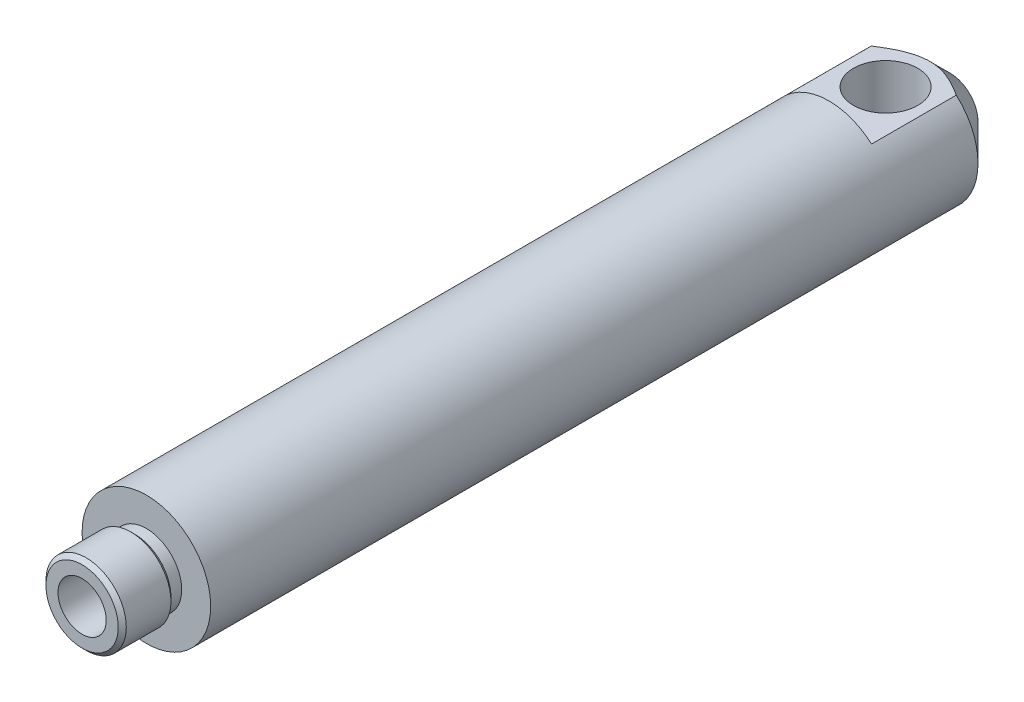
ISO-10303-21;
HEADER;
FILE_DESCRIPTION(('STEP AP214'),'2;1');
FILE_NAME('part.step','',(''),(''),'','','');
FILE_SCHEMA(('AUTOMOTIVE_DESIGN { 1 0 10303 214 1 1 1 1 }'));
ENDSEC;
DATA;
#1=APPLICATION_CONTEXT('core data for automotive mechanical design processes');
#2=APPLICATION_PROTOCOL_DEFINITION('international standard','automotive_design',2000,#1);
#3=PRODUCT_CONTEXT('',#1,'mechanical');
#4=PRODUCT('Part','Part','',(#3));
#5=PRODUCT_RELATED_PRODUCT_CATEGORY('part','',(#4));
#6=PRODUCT_DEFINITION_FORMATION('','',#4);
#7=PRODUCT_DEFINITION_CONTEXT('part definition',#1,'design');
#8=PRODUCT_DEFINITION('design','',#6,#7);
#9=PRODUCT_DEFINITION_SHAPE('','',#8);
#10=(LENGTH_UNIT() NAMED_UNIT(*) SI_UNIT(.MILLI.,.METRE.));
#11=(NAMED_UNIT(*) PLANE_ANGLE_UNIT() SI_UNIT($,.RADIAN.));
#12=(NAMED_UNIT(*) SI_UNIT($,.STERADIAN.) SOLID_ANGLE_UNIT());
#13=UNCERTAINTY_MEASURE_WITH_UNIT(LENGTH_MEASURE(1.E-05),#10,'distance_accuracy_value','');
#14=(GEOMETRIC_REPRESENTATION_CONTEXT(3) GLOBAL_UNCERTAINTY_ASSIGNED_CONTEXT((#13)) GLOBAL_UNIT_ASSIGNED_CONTEXT((#10,
#11,#12)) REPRESENTATION_CONTEXT('',''));
#15=CARTESIAN_POINT('',(0.,0.,0.));
#16=DIRECTION('',(0.,0.,1.));
#17=DIRECTION('',(1.,0.,0.));
#18=AXIS2_PLACEMENT_3D('',#15,#16,#17);
#19=CARTESIAN_POINT('',(0.,0.,158.75));
#20=DIRECTION('',(0.,0.,1.));
#21=DIRECTION('',(1.,0.,0.));
#22=AXIS2_PLACEMENT_3D('',#19,#20,#21);
#23=PLANE('',#22);
#24=CARTESIAN_POINT('',(0.,0.,158.75));
#25=DIRECTION('',(0.,0.,1.));
#26=DIRECTION('',(1.,0.,0.));
#27=AXIS2_PLACEMENT_3D('',#24,#25,#26);
#28=CIRCLE('',#27,12.70254);
#29=CARTESIAN_POINT('',(12.70254,0.,158.75));
#30=VERTEX_POINT('',#29);
#31=EDGE_CURVE('E276',#30,#30,#28,.T.);
#32=ORIENTED_EDGE('',*,*,#31,.T.);
#33=EDGE_LOOP('',(#32));
#34=FACE_BOUND('',#33,.T.);
#35=CARTESIAN_POINT('',(0.,0.,158.75));
#36=DIRECTION('',(0.,0.,-1.));
#37=DIRECTION('',(-1.,0.,0.));
#38=AXIS2_PLACEMENT_3D('',#35,#36,#37);
#39=CIRCLE('',#38,6.98499999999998);
#40=CARTESIAN_POINT('',(-6.98499999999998,0.,158.75));
#41=VERTEX_POINT('',#40);
#42=EDGE_CURVE('E271',#41,#41,#39,.T.);
#43=ORIENTED_EDGE('',*,*,#42,.T.);
#44=EDGE_LOOP('',(#43));
#45=FACE_BOUND('',#44,.T.);
#46=ADVANCED_FACE('F17',(#34,#45),#23,.T.);
#47=CARTESIAN_POINT('',(0.,0.,158.75));
#48=DIRECTION('',(0.,0.,-1.));
#49=DIRECTION('',(-1.,0.,0.));
#50=AXIS2_PLACEMENT_3D('',#47,#48,#49);
#51=CYLINDRICAL_SURFACE('',#50,12.70254);
#52=CARTESIAN_POINT('',(-12.70254,0.,156.7307));
#53=CARTESIAN_POINT('',(-12.702537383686,-0.141856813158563,156.730694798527));
#54=CARTESIAN_POINT('',(-12.7001393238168,-0.283779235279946,156.718835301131));
#55=CARTESIAN_POINT('',(-12.6908043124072,-0.563611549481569,156.671748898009));
#56=CARTESIAN_POINT('',(-12.6838637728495,-0.701518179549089,156.636503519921));
#57=CARTESIAN_POINT('',(-12.6662187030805,-0.969232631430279,156.54377890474));
#58=CARTESIAN_POINT('',(-12.6555177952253,-1.09904810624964,156.486321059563));
#59=CARTESIAN_POINT('',(-12.6315148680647,-1.34718755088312,156.350866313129));
#60=CARTESIAN_POINT('',(-12.6182129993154,-1.46551218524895,156.272870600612));
#61=CARTESIAN_POINT('',(-12.5902685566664,-1.68893701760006,156.097424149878));
#62=CARTESIAN_POINT('',(-12.5756115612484,-1.79385755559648,155.999746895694));
#63=CARTESIAN_POINT('',(-12.5467135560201,-1.98594012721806,155.788196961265));
#64=CARTESIAN_POINT('',(-12.532472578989,-2.07310076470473,155.674323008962));
#65=CARTESIAN_POINT('',(-12.5058781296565,-2.22795544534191,155.432318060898));
#66=CARTESIAN_POINT('',(-12.4935432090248,-2.29546320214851,155.304065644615));
#67=CARTESIAN_POINT('',(-12.4723623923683,-2.40790233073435,155.037749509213));
#68=CARTESIAN_POINT('',(-12.4635161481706,-2.45283595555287,154.899686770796));
#69=CARTESIAN_POINT('',(-12.4504602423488,-2.51826755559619,154.61960283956));
#70=CARTESIAN_POINT('',(-12.446190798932,-2.53908088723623,154.477658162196));
#71=CARTESIAN_POINT('',(-12.4425919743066,-2.55666066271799,154.192232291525));
#72=CARTESIAN_POINT('',(-12.4432620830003,-2.55342958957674,154.048751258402));
#73=CARTESIAN_POINT('',(-12.4494123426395,-2.52326718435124,153.766634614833));
#74=CARTESIAN_POINT('',(-12.4548190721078,-2.49669760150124,153.627958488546));
#75=CARTESIAN_POINT('',(-12.469717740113,-2.42118350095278,153.357073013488));
#76=CARTESIAN_POINT('',(-12.4792098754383,-2.37223790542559,153.224863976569));
#77=CARTESIAN_POINT('',(-12.5012847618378,-2.25301640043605,152.969624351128));
#78=CARTESIAN_POINT('',(-12.5138881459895,-2.18259731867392,152.846662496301));
#79=CARTESIAN_POINT('',(-12.5407522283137,-2.02252878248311,152.614165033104));
#80=CARTESIAN_POINT('',(-12.5550131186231,-1.93287709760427,152.504630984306));
#81=CARTESIAN_POINT('',(-12.5839032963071,-1.73495246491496,152.300011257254));
#82=CARTESIAN_POINT('',(-12.5985345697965,-1.6263708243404,152.205224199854));
#83=CARTESIAN_POINT('',(-12.6262797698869,-1.39469377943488,152.035161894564));
#84=CARTESIAN_POINT('',(-12.6393936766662,-1.27159818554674,151.959886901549));
#85=CARTESIAN_POINT('',(-12.6626592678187,-1.01405414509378,151.830929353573));
#86=CARTESIAN_POINT('',(-12.6728062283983,-0.879588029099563,151.777281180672));
#87=CARTESIAN_POINT('',(-12.688958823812,-0.603302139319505,151.693419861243));
#88=CARTESIAN_POINT('',(-12.6949649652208,-0.461483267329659,151.663203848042));
#89=CARTESIAN_POINT('',(-12.7020885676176,-0.177083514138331,151.627487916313));
#90=CARTESIAN_POINT('',(-12.7032868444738,-0.0345559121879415,151.621579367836));
#91=CARTESIAN_POINT('',(-12.7008842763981,0.249449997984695,151.633545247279));
#92=CARTESIAN_POINT('',(-12.697283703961,0.390928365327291,151.651418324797));
#93=CARTESIAN_POINT('',(-12.6857385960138,0.667499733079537,151.710100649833));
#94=CARTESIAN_POINT('',(-12.6778338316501,0.802639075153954,151.750699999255));
#95=CARTESIAN_POINT('',(-12.6585635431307,1.06419189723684,151.853452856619));
#96=CARTESIAN_POINT('',(-12.647197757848,1.19060471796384,151.915607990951));
#97=CARTESIAN_POINT('',(-12.6220650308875,1.43283778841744,152.060590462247));
#98=CARTESIAN_POINT('',(-12.6082701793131,1.54850800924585,152.143663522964));
#99=CARTESIAN_POINT('',(-12.5798747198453,1.76441311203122,152.327794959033));
#100=CARTESIAN_POINT('',(-12.565274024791,1.86464631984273,152.428855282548));
#101=CARTESIAN_POINT('',(-12.5366397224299,2.04841114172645,152.647953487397));
#102=CARTESIAN_POINT('',(-12.5226182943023,2.13166210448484,152.766228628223));
#103=CARTESIAN_POINT('',(-12.4969892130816,2.27711663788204,153.015324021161));
#104=CARTESIAN_POINT('',(-12.4853814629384,2.33932105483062,153.146143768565));
#105=CARTESIAN_POINT('',(-12.4659926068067,2.44053477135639,153.415953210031));
#106=CARTESIAN_POINT('',(-12.4581915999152,2.47966492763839,153.554896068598));
#107=CARTESIAN_POINT('',(-12.4472576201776,2.5339853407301,153.837558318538));
#108=CARTESIAN_POINT('',(-12.4441240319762,2.54917875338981,153.981277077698));
#109=CARTESIAN_POINT('',(-12.4429140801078,2.55507672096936,154.266593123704));
#110=CARTESIAN_POINT('',(-12.4447461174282,2.5462248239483,154.408181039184));
#111=CARTESIAN_POINT('',(-12.453056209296,2.50526299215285,154.687805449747));
#112=CARTESIAN_POINT('',(-12.4595342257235,2.47315324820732,154.825841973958));
#113=CARTESIAN_POINT('',(-12.4763652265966,2.38678588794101,155.094159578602));
#114=CARTESIAN_POINT('',(-12.4867086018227,2.33258316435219,155.224458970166));
#115=CARTESIAN_POINT('',(-12.5101102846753,2.20361958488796,155.474183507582));
#116=CARTESIAN_POINT('',(-12.5231688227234,2.12885698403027,155.593607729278));
#117=CARTESIAN_POINT('',(-12.5508094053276,1.95938310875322,155.820399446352));
#118=CARTESIAN_POINT('',(-12.5654137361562,1.86435172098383,155.927525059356));
#119=CARTESIAN_POINT('',(-12.5943409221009,1.65769815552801,156.124455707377));
#120=CARTESIAN_POINT('',(-12.6086637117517,1.54607216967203,156.214256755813));
#121=CARTESIAN_POINT('',(-12.6355928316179,1.30797805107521,156.374887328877));
#122=CARTESIAN_POINT('',(-12.6481793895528,1.18136532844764,156.445505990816));
#123=CARTESIAN_POINT('',(-12.6700230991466,0.91785182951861,156.564352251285));
#124=CARTESIAN_POINT('',(-12.6792832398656,0.780960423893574,156.612599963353));
#125=CARTESIAN_POINT('',(-12.6916389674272,0.536474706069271,156.676027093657));
#126=CARTESIAN_POINT('',(-12.6957028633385,0.430268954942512,156.696492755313));
#127=CARTESIAN_POINT('',(-12.7011543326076,0.216054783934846,156.723830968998));
#128=CARTESIAN_POINT('',(-12.7025419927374,0.108046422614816,156.730703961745));
#129=CARTESIAN_POINT('',(-12.70254,0.,156.7307));
#130=B_SPLINE_CURVE_WITH_KNOTS('',3,(#52,#53,#54,#55,#56,#57,#58,#59,#60,#61,#62,#63,#64,#65,
#66,#67,#68,#69,#70,#71,#72,#73,#74,#75,#76,#77,#78,#79,#80,#81,#82,#83,#84,#85,#86,#87,#88,#89,
#90,#91,#92,#93,#94,#95,#96,#97,#98,#99,#100,#101,#102,#103,#104,#105,#106,#107,#108,#109,#110,
#111,#112,#113,#114,#115,#116,#117,#118,#119,#120,#121,#122,#123,#124,#125,#126,#127,#128,#129),
.UNSPECIFIED.,.T.,.F.,(4,2,2,2,2,2,2,2,2,2,2,2,2,2,2,2,2,2,2,2,2,2,2,2,2,2,2,2,2,2,2,2,2,2,2,2,
2,2,4),(0.,0.425175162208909,0.850686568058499,1.2757891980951,1.70086722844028,
2.13114994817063,2.56146648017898,2.99573817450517,3.42996651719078,3.85845118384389,
4.28689160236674,4.70880606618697,5.13074085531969,5.55555275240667,5.98041394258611,
6.4129932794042,6.8455782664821,7.27884828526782,7.71206528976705,8.13796900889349,
8.56384854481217,8.98585809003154,9.40789948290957,9.83515092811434,10.2624486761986,
10.6963198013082,11.1301734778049,11.5617340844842,11.9932377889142,12.4168361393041,
12.8404310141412,13.262979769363,13.685564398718,14.11539594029,14.545326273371,
14.9798071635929,15.4138966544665,15.737745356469,16.0615835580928),.UNSPECIFIED.);
#131=CARTESIAN_POINT('',(-12.70254,0.,156.7307));
#132=VERTEX_POINT('',#131);
#133=EDGE_CURVE('E111',#132,#132,#130,.T.);
#134=ORIENTED_EDGE('',*,*,#133,.T.);
#135=EDGE_LOOP('',(#134));
#136=FACE_BOUND('',#135,.T.);
#137=DIRECTION('',(0.,0.,-1.));
#138=VECTOR('',#137,1.);
#139=CARTESIAN_POINT('',(-11.8991802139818,4.44567572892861,158.75));
#140=LINE('',#139,#138);
#141=CARTESIAN_POINT('',(-11.8991802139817,4.4456757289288,133.1976));
#142=VERTEX_POINT('',#141);
#143=CARTESIAN_POINT('',(-11.8991802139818,4.44567572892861,140.8811));
#144=VERTEX_POINT('',#143);
#145=EDGE_CURVE('E551',#142,#144,#140,.F.);
#146=ORIENTED_EDGE('',*,*,#145,.T.);
#147=CARTESIAN_POINT('',(-11.8991802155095,4.44567572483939,140.8809));
#148=CARTESIAN_POINT('',(-11.8991395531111,4.44570609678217,141.032224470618));
#149=CARTESIAN_POINT('',(-11.9017985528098,4.43866560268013,141.183532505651));
#150=CARTESIAN_POINT('',(-11.9122323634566,4.41062935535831,141.48464478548));
#151=CARTESIAN_POINT('',(-11.9200061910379,4.38963628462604,141.634449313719));
#152=CARTESIAN_POINT('',(-11.940348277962,4.33398537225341,141.930588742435));
#153=CARTESIAN_POINT('',(-11.9528985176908,4.29937887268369,142.076934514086));
#154=CARTESIAN_POINT('',(-11.9822545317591,4.21687255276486,142.365327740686));
#155=CARTESIAN_POINT('',(-11.9990598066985,4.16897429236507,142.507375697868));
#156=CARTESIAN_POINT('',(-12.0497897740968,4.02081938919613,142.887055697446));
#157=CARTESIAN_POINT('',(-12.0872955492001,3.9077728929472,143.119364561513));
#158=CARTESIAN_POINT('',(-12.1688251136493,3.64594805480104,143.561538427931));
#159=CARTESIAN_POINT('',(-12.2128504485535,3.49716123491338,143.771398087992));
#160=CARTESIAN_POINT('',(-12.3038796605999,3.16227229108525,144.168836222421));
#161=CARTESIAN_POINT('',(-12.3509324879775,2.97523816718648,144.355621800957));
#162=CARTESIAN_POINT('',(-12.441409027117,2.57074164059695,144.693920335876));
#163=CARTESIAN_POINT('',(-12.4848329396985,2.3532809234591,144.845435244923));
#164=CARTESIAN_POINT('',(-12.5616041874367,1.90043889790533,145.103388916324));
#165=CARTESIAN_POINT('',(-12.595220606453,1.66581549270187,145.211071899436));
#166=CARTESIAN_POINT('',(-12.649983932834,1.17983696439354,145.38304183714));
#167=CARTESIAN_POINT('',(-12.6711401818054,0.928494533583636,145.447361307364));
#168=CARTESIAN_POINT('',(-12.6971292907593,0.438777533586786,145.525946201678));
#169=CARTESIAN_POINT('',(-12.7031717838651,0.201059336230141,145.543924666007));
#170=CARTESIAN_POINT('',(-12.7018036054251,-0.273965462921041,145.539832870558));
#171=CARTESIAN_POINT('',(-12.694396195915,-0.511272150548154,145.517772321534));
#172=CARTESIAN_POINT('',(-12.6675972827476,-0.967739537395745,145.436532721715));
#173=CARTESIAN_POINT('',(-12.6487525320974,-1.18723808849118,145.379045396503));
#174=CARTESIAN_POINT('',(-12.6014673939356,-1.61356242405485,145.230803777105));
#175=CARTESIAN_POINT('',(-12.5730256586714,-1.82038642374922,145.140044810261));
#176=CARTESIAN_POINT('',(-12.5079702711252,-2.22458560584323,144.92420962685));
#177=CARTESIAN_POINT('',(-12.4710785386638,-2.42126631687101,144.797921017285));
#178=CARTESIAN_POINT('',(-12.3933433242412,-2.79204503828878,144.516678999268));
#179=CARTESIAN_POINT('',(-12.3524984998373,-2.96613532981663,144.361715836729));
#180=CARTESIAN_POINT('',(-12.2672500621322,-3.30173968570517,144.013537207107));
#181=CARTESIAN_POINT('',(-12.2228266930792,-3.46108590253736,143.818237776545));
#182=CARTESIAN_POINT('',(-12.138330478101,-3.7466953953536,143.403669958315));
#183=CARTESIAN_POINT('',(-12.0982600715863,-3.87294017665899,143.184388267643));
#184=CARTESIAN_POINT('',(-12.0438177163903,-4.03788534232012,142.836395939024));
#185=CARTESIAN_POINT('',(-12.0262867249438,-4.08966742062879,142.714204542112));
#186=CARTESIAN_POINT('',(-11.9941328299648,-4.18303070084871,142.465628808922));
#187=CARTESIAN_POINT('',(-11.9795088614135,-4.22461563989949,142.339246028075));
#188=CARTESIAN_POINT('',(-11.9536465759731,-4.29724804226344,142.083321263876));
#189=CARTESIAN_POINT('',(-11.9424042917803,-4.32830785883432,141.953783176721));
#190=CARTESIAN_POINT('',(-11.9236475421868,-4.37971485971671,141.692386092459));
#191=CARTESIAN_POINT('',(-11.9161311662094,-4.40006753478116,141.560528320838));
#192=CARTESIAN_POINT('',(-11.9068080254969,-4.42521905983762,141.337172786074));
#193=CARTESIAN_POINT('',(-11.9039488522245,-4.4328970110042,141.246031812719));
#194=CARTESIAN_POINT('',(-11.9001334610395,-4.44312434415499,141.063563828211));
#195=CARTESIAN_POINT('',(-11.8991743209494,-4.44568160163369,140.972237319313));
#196=CARTESIAN_POINT('',(-11.8991802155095,-4.44567572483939,140.8809));
#197=B_SPLINE_CURVE_WITH_KNOTS('',3,(#147,#148,#149,#150,#151,#152,#153,#154,#155,#156,#157,
#158,#159,#160,#161,#162,#163,#164,#165,#166,#167,#168,#169,#170,#171,#172,#173,#174,#175,#176,
#177,#178,#179,#180,#181,#182,#183,#184,#185,#186,#187,#188,#189,#190,#191,#192,#193,#194,#195,
#196),.UNSPECIFIED.,.F.,.F.,(4,2,2,2,2,2,2,2,2,2,2,2,2,2,2,2,2,2,2,2,2,2,2,2,4),(0.,
0.453758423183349,0.907429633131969,1.35940601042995,1.81132936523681,2.59072381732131,
3.37030333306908,4.17181390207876,4.97328008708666,5.75006989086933,6.52627657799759,
7.23802555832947,7.94960193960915,8.62958114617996,9.30965588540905,10.0165552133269,
10.7236954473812,11.4882347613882,12.2532003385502,12.6543850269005,13.0554224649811,
13.4559875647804,13.8563470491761,14.1307189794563,14.4046686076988),.UNSPECIFIED.);
#198=CARTESIAN_POINT('',(-11.8991802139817,-4.44567572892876,140.8811));
#199=VERTEX_POINT('',#198);
#200=EDGE_CURVE('E166',#144,#199,#197,.T.);
#201=ORIENTED_EDGE('',*,*,#200,.T.);
#202=DIRECTION('',(0.,0.,-1.));
#203=VECTOR('',#202,1.);
#204=CARTESIAN_POINT('',(-11.8991802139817,-4.44567572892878,158.75));
#205=LINE('',#204,#203);
#206=CARTESIAN_POINT('',(-11.8991802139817,-4.44567572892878,133.1976));
#207=VERTEX_POINT('',#206);
#208=EDGE_CURVE('E170',#199,#207,#205,.T.);
#209=ORIENTED_EDGE('',*,*,#208,.T.);
#210=CARTESIAN_POINT('',(-11.8991802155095,-4.44567572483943,133.1978));
#211=CARTESIAN_POINT('',(-11.899139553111,-4.4457060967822,133.046475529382));
#212=CARTESIAN_POINT('',(-11.9017985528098,-4.43866560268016,132.89516749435));
#213=CARTESIAN_POINT('',(-11.9122323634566,-4.41062935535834,132.59405521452));
#214=CARTESIAN_POINT('',(-11.9200061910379,-4.38963628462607,132.444250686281));
#215=CARTESIAN_POINT('',(-11.940348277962,-4.33398537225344,132.148111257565));
#216=CARTESIAN_POINT('',(-11.9528985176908,-4.29937887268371,132.001765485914));
#217=CARTESIAN_POINT('',(-11.9822545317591,-4.21687255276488,131.713372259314));
#218=CARTESIAN_POINT('',(-11.9990598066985,-4.1689742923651,131.571324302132));
#219=CARTESIAN_POINT('',(-12.0497897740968,-4.02081938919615,131.191644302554));
#220=CARTESIAN_POINT('',(-12.0872955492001,-3.90777289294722,130.959335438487));
#221=CARTESIAN_POINT('',(-12.1688251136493,-3.64594805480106,130.517161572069));
#222=CARTESIAN_POINT('',(-12.2128504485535,-3.4971612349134,130.307301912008));
#223=CARTESIAN_POINT('',(-12.3038796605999,-3.16227229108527,129.909863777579));
#224=CARTESIAN_POINT('',(-12.3509324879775,-2.97523816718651,129.723078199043));
#225=CARTESIAN_POINT('',(-12.441409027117,-2.57074164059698,129.384779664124));
#226=CARTESIAN_POINT('',(-12.4848329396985,-2.35328092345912,129.233264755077));
#227=CARTESIAN_POINT('',(-12.5616041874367,-1.90043889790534,128.975311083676));
#228=CARTESIAN_POINT('',(-12.595220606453,-1.66581549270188,128.867628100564));
#229=CARTESIAN_POINT('',(-12.649983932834,-1.17983696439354,128.69565816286));
#230=CARTESIAN_POINT('',(-12.6711401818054,-0.928494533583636,128.631338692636));
#231=CARTESIAN_POINT('',(-12.6971292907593,-0.438777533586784,128.552753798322));
#232=CARTESIAN_POINT('',(-12.7031717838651,-0.201059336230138,128.534775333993));
#233=CARTESIAN_POINT('',(-12.7018036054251,0.273965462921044,128.538867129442));
#234=CARTESIAN_POINT('',(-12.694396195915,0.511272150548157,128.560927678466));
#235=CARTESIAN_POINT('',(-12.6675972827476,0.967739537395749,128.642167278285));
#236=CARTESIAN_POINT('',(-12.6487525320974,1.18723808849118,128.699654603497));
#237=CARTESIAN_POINT('',(-12.6014673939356,1.61356242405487,128.847896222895));
#238=CARTESIAN_POINT('',(-12.5730256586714,1.82038642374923,128.938655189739));
#239=CARTESIAN_POINT('',(-12.5079702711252,2.22458560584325,129.15449037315));
#240=CARTESIAN_POINT('',(-12.4710785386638,2.42126631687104,129.280778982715));
#241=CARTESIAN_POINT('',(-12.3933433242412,2.79204503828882,129.562021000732));
#242=CARTESIAN_POINT('',(-12.3524984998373,2.96613532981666,129.716984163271));
#243=CARTESIAN_POINT('',(-12.2672500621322,3.30173968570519,130.065162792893));
#244=CARTESIAN_POINT('',(-12.2228266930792,3.46108590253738,130.260462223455));
#245=CARTESIAN_POINT('',(-12.138330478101,3.74669539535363,130.675030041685));
#246=CARTESIAN_POINT('',(-12.0982600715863,3.87294017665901,130.894311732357));
#247=CARTESIAN_POINT('',(-12.0438177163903,4.03788534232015,131.242304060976));
#248=CARTESIAN_POINT('',(-12.0262867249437,4.08966742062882,131.364495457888));
#249=CARTESIAN_POINT('',(-11.9941328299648,4.18303070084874,131.613071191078));
#250=CARTESIAN_POINT('',(-11.9795088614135,4.22461563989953,131.739453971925));
#251=CARTESIAN_POINT('',(-11.9536465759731,4.29724804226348,131.995378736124));
#252=CARTESIAN_POINT('',(-11.9424042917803,4.32830785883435,132.124916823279));
#253=CARTESIAN_POINT('',(-11.9236475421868,4.37971485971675,132.386313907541));
#254=CARTESIAN_POINT('',(-11.9161311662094,4.40006753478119,132.518171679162));
#255=CARTESIAN_POINT('',(-11.9068080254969,4.42521905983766,132.741527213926));
#256=CARTESIAN_POINT('',(-11.9039488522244,4.43289701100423,132.832668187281));
#257=CARTESIAN_POINT('',(-11.9001334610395,4.44312434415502,133.015136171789));
#258=CARTESIAN_POINT('',(-11.8991743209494,4.44568160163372,133.106462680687));
#259=CARTESIAN_POINT('',(-11.8991802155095,4.44567572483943,133.1978));
#260=B_SPLINE_CURVE_WITH_KNOTS('',3,(#210,#211,#212,#213,#214,#215,#216,#217,#218,#219,#220,
#221,#222,#223,#224,#225,#226,#227,#228,#229,#230,#231,#232,#233,#234,#235,#236,#237,#238,#239,
#240,#241,#242,#243,#244,#245,#246,#247,#248,#249,#250,#251,#252,#253,#254,#255,#256,#257,#258,
#259),.UNSPECIFIED.,.F.,.F.,(4,2,2,2,2,2,2,2,2,2,2,2,2,2,2,2,2,2,2,2,2,2,2,2,4),(0.,
0.453758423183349,0.907429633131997,1.35940601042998,1.81132936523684,2.59072381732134,
3.37030333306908,4.17181390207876,4.97328008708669,5.75006989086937,6.52627657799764,
7.23802555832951,7.9496019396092,8.62958114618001,9.30965588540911,10.0165552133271,
10.7236954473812,11.4882347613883,12.2532003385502,12.6543850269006,13.0554224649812,
13.4559875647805,13.8563470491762,14.1307189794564,14.4046686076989),.UNSPECIFIED.);
#261=EDGE_CURVE('E530',#207,#142,#260,.T.);
#262=ORIENTED_EDGE('',*,*,#261,.T.);
#263=EDGE_LOOP('',(#146,#201,#209,#262));
#264=FACE_BOUND('',#263,.T.);
#265=ORIENTED_EDGE('',*,*,#31,.F.);
#266=EDGE_LOOP('',(#265));
#267=FACE_BOUND('',#266,.T.);
#268=DIRECTION('',(0.,0.,-1.));
#269=VECTOR('',#268,1.);
#270=CARTESIAN_POINT('',(-8.40410003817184,9.525,158.75));
#271=LINE('',#270,#269);
#272=CARTESIAN_POINT('',(-8.40410003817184,9.525,23.876));
#273=VERTEX_POINT('',#272);
#274=CARTESIAN_POINT('',(-8.40410003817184,9.525,7.14628999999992));
#275=VERTEX_POINT('',#274);
#276=EDGE_CURVE('E294',#273,#275,#271,.T.);
#277=ORIENTED_EDGE('',*,*,#276,.T.);
#278=CARTESIAN_POINT('',(0.,0.,7.14628999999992));
#279=DIRECTION('',(0.,0.,1.));
#280=DIRECTION('',(1.,0.,0.));
#281=AXIS2_PLACEMENT_3D('',#278,#279,#280);
#282=CIRCLE('',#281,12.70254);
#283=CARTESIAN_POINT('',(-8.40410003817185,-9.525,7.14628999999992));
#284=VERTEX_POINT('',#283);
#285=EDGE_CURVE('E183',#275,#284,#282,.T.);
#286=ORIENTED_EDGE('',*,*,#285,.T.);
#287=DIRECTION('',(0.,0.,-1.));
#288=VECTOR('',#287,1.);
#289=CARTESIAN_POINT('',(-8.40410003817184,-9.525,158.75));
#290=LINE('',#289,#288);
#291=CARTESIAN_POINT('',(-8.40410003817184,-9.525,23.876));
#292=VERTEX_POINT('',#291);
#293=EDGE_CURVE('E287',#284,#292,#290,.F.);
#294=ORIENTED_EDGE('',*,*,#293,.T.);
#295=CARTESIAN_POINT('',(0.,0.,23.876));
#296=DIRECTION('',(0.,0.,-1.));
#297=DIRECTION('',(-1.,0.,0.));
#298=AXIS2_PLACEMENT_3D('',#295,#296,#297);
#299=CIRCLE('',#298,12.70254);
#300=CARTESIAN_POINT('',(8.40410003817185,-9.525,23.876));
#301=VERTEX_POINT('',#300);
#302=EDGE_CURVE('E278',#301,#292,#299,.T.);
#303=ORIENTED_EDGE('',*,*,#302,.F.);
#304=DIRECTION('',(0.,0.,-1.));
#305=VECTOR('',#304,1.);
#306=CARTESIAN_POINT('',(8.40410003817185,-9.525,158.75));
#307=LINE('',#306,#305);
#308=CARTESIAN_POINT('',(8.40410003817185,-9.525,7.14628999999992));
#309=VERTEX_POINT('',#308);
#310=EDGE_CURVE('E280',#301,#309,#307,.T.);
#311=ORIENTED_EDGE('',*,*,#310,.T.);
#312=CARTESIAN_POINT('',(8.40410003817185,9.525,7.14628999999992));
#313=VERTEX_POINT('',#312);
#314=EDGE_CURVE('E180',#309,#313,#282,.T.);
#315=ORIENTED_EDGE('',*,*,#314,.T.);
#316=DIRECTION('',(0.,0.,-1.));
#317=VECTOR('',#316,1.);
#318=CARTESIAN_POINT('',(8.40410003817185,9.525,158.75));
#319=LINE('',#318,#317);
#320=CARTESIAN_POINT('',(8.40410003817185,9.525,23.876));
#321=VERTEX_POINT('',#320);
#322=EDGE_CURVE('E292',#313,#321,#319,.F.);
#323=ORIENTED_EDGE('',*,*,#322,.T.);
#324=CARTESIAN_POINT('',(0.,0.,23.876));
#325=DIRECTION('',(0.,0.,-1.));
#326=DIRECTION('',(-1.,0.,0.));
#327=AXIS2_PLACEMENT_3D('',#324,#325,#326);
#328=CIRCLE('',#327,12.70254);
#329=EDGE_CURVE('E218',#273,#321,#328,.T.);
#330=ORIENTED_EDGE('',*,*,#329,.F.);
#331=EDGE_LOOP('',(#277,#286,#294,#303,#311,#315,#323,#330));
#332=FACE_BOUND('',#331,.T.);
#333=ADVANCED_FACE('F19',(#136,#264,#267,#332),#51,.T.);
#334=CARTESIAN_POINT('',(0.,7.9375,161.036));
#335=DIRECTION('',(0.,0.,1.));
#336=DIRECTION('',(1.,0.,0.));
#337=AXIS2_PLACEMENT_3D('',#334,#335,#336);
#338=PLANE('',#337);
#339=CARTESIAN_POINT('',(0.,0.,161.036));
#340=DIRECTION('',(0.,0.,1.));
#341=DIRECTION('',(1.,0.,0.));
#342=AXIS2_PLACEMENT_3D('',#339,#340,#341);
#343=CIRCLE('',#342,7.14374999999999);
#344=CARTESIAN_POINT('',(7.14374999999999,0.,161.036));
#345=VERTEX_POINT('',#344);
#346=EDGE_CURVE('E524',#345,#345,#343,.F.);
#347=ORIENTED_EDGE('',*,*,#346,.T.);
#348=EDGE_LOOP('',(#347));
#349=FACE_BOUND('',#348,.T.);
#350=CARTESIAN_POINT('',(0.,0.,161.036));
#351=DIRECTION('',(0.,0.,-1.));
#352=DIRECTION('',(-1.,0.,0.));
#353=AXIS2_PLACEMENT_3D('',#350,#351,#352);
#354=CIRCLE('',#353,6.98499999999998);
#355=CARTESIAN_POINT('',(-6.98499999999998,0.,161.036));
#356=VERTEX_POINT('',#355);
#357=EDGE_CURVE('E274',#356,#356,#354,.T.);
#358=ORIENTED_EDGE('',*,*,#357,.F.);
#359=EDGE_LOOP('',(#358));
#360=FACE_BOUND('',#359,.T.);
#361=ADVANCED_FACE('F244',(#349,#360),#338,.F.);
#362=CARTESIAN_POINT('',(0.,0.,0.));
#363=DIRECTION('',(0.,0.,-1.));
#364=DIRECTION('',(-1.,0.,0.));
#365=AXIS2_PLACEMENT_3D('',#362,#363,#364);
#366=CYLINDRICAL_SURFACE('',#365,6.98499999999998);
#367=ORIENTED_EDGE('',*,*,#42,.F.);
#368=EDGE_LOOP('',(#367));
#369=FACE_BOUND('',#368,.T.);
#370=ORIENTED_EDGE('',*,*,#357,.T.);
#371=EDGE_LOOP('',(#370));
#372=FACE_BOUND('',#371,.T.);
#373=ADVANCED_FACE('F257',(#369,#372),#366,.T.);
#374=CARTESIAN_POINT('',(0.,0.,171.45));
#375=DIRECTION('',(0.,0.,1.));
#376=DIRECTION('',(1.,0.,0.));
#377=AXIS2_PLACEMENT_3D('',#374,#375,#376);
#378=PLANE('',#377);
#379=CARTESIAN_POINT('',(0.,0.,171.45));
#380=DIRECTION('',(0.,0.,1.));
#381=DIRECTION('',(1.,0.,0.));
#382=AXIS2_PLACEMENT_3D('',#379,#380,#381);
#383=CIRCLE('',#382,7.14374999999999);
#384=CARTESIAN_POINT('',(7.14374999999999,0.,171.45));
#385=VERTEX_POINT('',#384);
#386=EDGE_CURVE('E11',#385,#385,#383,.T.);
#387=ORIENTED_EDGE('',*,*,#386,.T.);
#388=EDGE_LOOP('',(#387));
#389=FACE_BOUND('',#388,.T.);
#390=CARTESIAN_POINT('',(0.,0.,171.45));
#391=DIRECTION('',(0.,0.,1.));
#392=DIRECTION('',(1.,0.,0.));
#393=AXIS2_PLACEMENT_3D('',#390,#391,#392);
#394=CIRCLE('',#393,4.76123);
#395=CARTESIAN_POINT('',(4.76123,0.,171.45));
#396=VERTEX_POINT('',#395);
#397=EDGE_CURVE('E164',#396,#396,#394,.T.);
#398=ORIENTED_EDGE('',*,*,#397,.F.);
#399=EDGE_LOOP('',(#398));
#400=FACE_BOUND('',#399,.T.);
#401=ADVANCED_FACE('F253',(#389,#400),#378,.T.);
#402=CARTESIAN_POINT('',(0.,0.,171.45));
#403=DIRECTION('',(0.,0.,-1.));
#404=DIRECTION('',(-1.,0.,0.));
#405=AXIS2_PLACEMENT_3D('',#402,#403,#404);
#406=CYLINDRICAL_SURFACE('',#405,7.9375);
#407=CARTESIAN_POINT('',(0.,0.,161.82975));
#408=DIRECTION('',(0.,0.,1.));
#409=DIRECTION('',(1.,0.,0.));
#410=AXIS2_PLACEMENT_3D('',#407,#408,#409);
#411=CIRCLE('',#410,7.9375);
#412=CARTESIAN_POINT('',(7.9375,0.,161.82975));
#413=VERTEX_POINT('',#412);
#414=EDGE_CURVE('E26',#413,#413,#411,.T.);
#415=ORIENTED_EDGE('',*,*,#414,.T.);
#416=EDGE_LOOP('',(#415));
#417=FACE_BOUND('',#416,.T.);
#418=CARTESIAN_POINT('',(0.,0.,170.65625));
#419=DIRECTION('',(0.,0.,1.));
#420=DIRECTION('',(1.,0.,0.));
#421=AXIS2_PLACEMENT_3D('',#418,#419,#420);
#422=CIRCLE('',#421,7.9375);
#423=CARTESIAN_POINT('',(7.9375,0.,170.65625));
#424=VERTEX_POINT('',#423);
#425=EDGE_CURVE('E521',#424,#424,#422,.F.);
#426=ORIENTED_EDGE('',*,*,#425,.T.);
#427=EDGE_LOOP('',(#426));
#428=FACE_BOUND('',#427,.T.);
#429=ADVANCED_FACE('F235',(#417,#428),#406,.T.);
#430=CARTESIAN_POINT('',(0.,-14.2875,12.7));
#431=DIRECTION('',(0.,1.,0.));
#432=DIRECTION('',(0.,0.,1.));
#433=AXIS2_PLACEMENT_3D('',#430,#431,#432);
#434=CYLINDRICAL_SURFACE('',#433,6.3627);
#435=CARTESIAN_POINT('',(0.,9.525,12.7));
#436=DIRECTION('',(0.,-1.,0.));
#437=DIRECTION('',(1.,0.,0.));
#438=AXIS2_PLACEMENT_3D('',#435,#436,#437);
#439=CIRCLE('',#438,6.3627);
#440=CARTESIAN_POINT('',(0.,9.525,19.0627));
#441=VERTEX_POINT('',#440);
#442=EDGE_CURVE('E290',#441,#441,#439,.F.);
#443=CARTESIAN_POINT('',(0.,-9.525,12.7));
#444=DIRECTION('',(0.,1.,0.));
#445=DIRECTION('',(-1.,0.,0.));
#446=AXIS2_PLACEMENT_3D('',#443,#444,#445);
#447=CIRCLE('',#446,6.3627);
#448=CARTESIAN_POINT('',(0.,-9.525,19.0627));
#449=VERTEX_POINT('',#448);
#450=EDGE_CURVE('E284',#449,#449,#447,.F.);
#451=CARTESIAN_POINT('',(0.,9.525,19.0627));
#452=CARTESIAN_POINT('',(0.,9.32656249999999,19.0627));
#453=CARTESIAN_POINT('',(0.,9.128125,19.0627));
#454=CARTESIAN_POINT('',(0.,8.73124999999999,19.0627));
#455=CARTESIAN_POINT('',(0.,8.5328125,19.0627));
#456=CARTESIAN_POINT('',(0.,8.13593749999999,19.0627));
#457=CARTESIAN_POINT('',(0.,7.93749999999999,19.0627));
#458=CARTESIAN_POINT('',(0.,7.54062499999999,19.0627));
#459=CARTESIAN_POINT('',(0.,7.34218749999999,19.0627));
#460=CARTESIAN_POINT('',(0.,6.94531249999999,19.0627));
#461=CARTESIAN_POINT('',(0.,6.746875,19.0627));
#462=CARTESIAN_POINT('',(0.,6.35,19.0627));
#463=CARTESIAN_POINT('',(0.,6.1515625,19.0627));
#464=CARTESIAN_POINT('',(0.,5.7546875,19.0627));
#465=CARTESIAN_POINT('',(0.,5.55625,19.0627));
#466=CARTESIAN_POINT('',(0.,5.159375,19.0627));
#467=CARTESIAN_POINT('',(0.,4.9609375,19.0627));
#468=CARTESIAN_POINT('',(0.,4.5640625,19.0627));
#469=CARTESIAN_POINT('',(0.,4.365625,19.0627));
#470=CARTESIAN_POINT('',(0.,3.96875,19.0627));
#471=CARTESIAN_POINT('',(0.,3.7703125,19.0627));
#472=CARTESIAN_POINT('',(0.,3.3734375,19.0627));
#473=CARTESIAN_POINT('',(0.,3.175,19.0627));
#474=CARTESIAN_POINT('',(0.,2.778125,19.0627));
#475=CARTESIAN_POINT('',(0.,2.5796875,19.0627));
#476=CARTESIAN_POINT('',(0.,2.1828125,19.0627));
#477=CARTESIAN_POINT('',(0.,1.984375,19.0627));
#478=CARTESIAN_POINT('',(0.,1.5875,19.0627));
#479=CARTESIAN_POINT('',(0.,1.3890625,19.0627));
#480=CARTESIAN_POINT('',(0.,0.992187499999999,19.0627));
#481=CARTESIAN_POINT('',(0.,0.793749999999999,19.0627));
#482=CARTESIAN_POINT('',(0.,0.396874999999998,19.0627));
#483=CARTESIAN_POINT('',(0.,0.198437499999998,19.0627));
#484=CARTESIAN_POINT('',(0.,-0.198437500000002,19.0627));
#485=CARTESIAN_POINT('',(0.,-0.396875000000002,19.0627));
#486=CARTESIAN_POINT('',(0.,-0.793750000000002,19.0627));
#487=CARTESIAN_POINT('',(0.,-0.992187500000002,19.0627));
#488=CARTESIAN_POINT('',(0.,-1.3890625,19.0627));
#489=CARTESIAN_POINT('',(0.,-1.5875,19.0627));
#490=CARTESIAN_POINT('',(0.,-1.984375,19.0627));
#491=CARTESIAN_POINT('',(0.,-2.1828125,19.0627));
#492=CARTESIAN_POINT('',(0.,-2.5796875,19.0627));
#493=CARTESIAN_POINT('',(0.,-2.778125,19.0627));
#494=CARTESIAN_POINT('',(0.,-3.175,19.0627));
#495=CARTESIAN_POINT('',(0.,-3.3734375,19.0627));
#496=CARTESIAN_POINT('',(0.,-3.7703125,19.0627));
#497=CARTESIAN_POINT('',(0.,-3.96875,19.0627));
#498=CARTESIAN_POINT('',(0.,-4.365625,19.0627));
#499=CARTESIAN_POINT('',(0.,-4.5640625,19.0627));
#500=CARTESIAN_POINT('',(0.,-4.9609375,19.0627));
#501=CARTESIAN_POINT('',(0.,-5.159375,19.0627));
#502=CARTESIAN_POINT('',(0.,-5.55625,19.0627));
#503=CARTESIAN_POINT('',(0.,-5.7546875,19.0627));
#504=CARTESIAN_POINT('',(0.,-6.1515625,19.0627));
#505=CARTESIAN_POINT('',(0.,-6.35,19.0627));
#506=CARTESIAN_POINT('',(0.,-6.746875,19.0627));
#507=CARTESIAN_POINT('',(0.,-6.9453125,19.0627));
#508=CARTESIAN_POINT('',(0.,-7.3421875,19.0627));
#509=CARTESIAN_POINT('',(0.,-7.540625,19.0627));
#510=CARTESIAN_POINT('',(0.,-7.9375,19.0627));
#511=CARTESIAN_POINT('',(0.,-8.1359375,19.0627));
#512=CARTESIAN_POINT('',(0.,-8.5328125,19.0627));
#513=CARTESIAN_POINT('',(0.,-8.73125,19.0627));
#514=CARTESIAN_POINT('',(0.,-9.128125,19.0627));
#515=CARTESIAN_POINT('',(0.,-9.3265625,19.0627));
#516=CARTESIAN_POINT('',(0.,-9.525,19.0627));
#517=B_SPLINE_CURVE_WITH_KNOTS('',3,(#451,#452,#453,#454,#455,#456,#457,#458,#459,#460,#461,
#462,#463,#464,#465,#466,#467,#468,#469,#470,#471,#472,#473,#474,#475,#476,#477,#478,#479,#480,
#481,#482,#483,#484,#485,#486,#487,#488,#489,#490,#491,#492,#493,#494,#495,#496,#497,#498,#499,
#500,#501,#502,#503,#504,#505,#506,#507,#508,#509,#510,#511,#512,#513,#514,#515,#516),
.UNSPECIFIED.,.F.,.F.,(4,2,2,2,2,2,2,2,2,2,2,2,2,2,2,2,2,2,2,2,2,2,2,2,2,2,2,2,2,2,2,2,4),(0.,
0.5953125,1.190625,1.7859375,2.38125,2.9765625,3.571875,4.1671875,4.7625,5.3578125,5.953125,
6.5484375,7.14375,7.7390625,8.334375,8.9296875,9.525,10.1203125,10.715625,11.3109375,11.90625,
12.5015625,13.096875,13.6921875,14.2875,14.8828125,15.478125,16.0734375,16.66875,17.2640625,
17.859375,18.4546875,19.05),.UNSPECIFIED.);
#518=EDGE_CURVE('BSEAM226',#441,#449,#517,.T.);
#519=ORIENTED_EDGE('',*,*,#442,.T.);
#520=ORIENTED_EDGE('',*,*,#450,.T.);
#521=ORIENTED_EDGE('',*,*,#518,.T.);
#522=ORIENTED_EDGE('',*,*,#518,.F.);
#523=EDGE_LOOP('',(#519,#521,#520,#522));
#524=FACE_BOUND('',#523,.T.);
#525=ADVANCED_FACE('F226',(#524),#434,.F.);
#526=CARTESIAN_POINT('',(-12.70254,-9.525,23.876));
#527=DIRECTION('',(0.,0.,-1.));
#528=DIRECTION('',(-1.,0.,0.));
#529=AXIS2_PLACEMENT_3D('',#526,#527,#528);
#530=PLANE('',#529);
#531=DIRECTION('',(1.,0.,0.));
#532=VECTOR('',#531,1.);
#533=CARTESIAN_POINT('',(-12.70254,-9.525,23.876));
#534=LINE('',#533,#532);
#535=EDGE_CURVE('E288',#292,#301,#534,.T.);
#536=ORIENTED_EDGE('',*,*,#535,.T.);
#537=ORIENTED_EDGE('',*,*,#302,.T.);
#538=EDGE_LOOP('',(#536,#537));
#539=FACE_BOUND('',#538,.T.);
#540=ADVANCED_FACE('F224',(#539),#530,.T.);
#541=CARTESIAN_POINT('',(-12.70254,-9.525,23.876));
#542=DIRECTION('',(0.,1.,0.));
#543=DIRECTION('',(-1.,0.,0.));
#544=AXIS2_PLACEMENT_3D('',#541,#542,#543);
#545=PLANE('',#544);
#546=ORIENTED_EDGE('',*,*,#450,.F.);
#547=EDGE_LOOP('',(#546));
#548=FACE_BOUND('',#547,.T.);
#549=ORIENTED_EDGE('',*,*,#293,.F.);
#550=CARTESIAN_POINT('',(-16.8127902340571,-9.525,13.7671953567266));
#551=CARTESIAN_POINT('',(-16.6111639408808,-9.525,13.5917683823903));
#552=CARTESIAN_POINT('',(-16.4091605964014,-9.525,13.4167748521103));
#553=CARTESIAN_POINT('',(-16.0043213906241,-9.525,13.0677504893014));
#554=CARTESIAN_POINT('',(-15.8014855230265,-9.525,12.8937196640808));
#555=CARTESIAN_POINT('',(-15.1915544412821,-9.525,12.3731663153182));
#556=CARTESIAN_POINT('',(-14.7830968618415,-9.525,12.0282361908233));
#557=CARTESIAN_POINT('',(-13.9590040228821,-9.525,11.3413005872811));
#558=CARTESIAN_POINT('',(-13.5433388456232,-9.525,10.9993309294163));
#559=CARTESIAN_POINT('',(-12.7065986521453,-9.525,10.3221284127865));
#560=CARTESIAN_POINT('',(-12.2855240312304,-9.525,9.98689506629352));
#561=CARTESIAN_POINT('',(-11.401837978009,-9.525,9.29785977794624));
#562=CARTESIAN_POINT('',(-10.9386521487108,-9.525,8.9447897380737));
#563=CARTESIAN_POINT('',(-10.236311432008,-9.525,8.42527444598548));
#564=CARTESIAN_POINT('',(-10.0009033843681,-9.525,8.25376054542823));
#565=CARTESIAN_POINT('',(-9.52724664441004,-9.525,7.91470614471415));
#566=CARTESIAN_POINT('',(-9.28899803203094,-9.525,7.74716553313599));
#567=CARTESIAN_POINT('',(-8.80996097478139,-9.525,7.41722197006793));
#568=CARTESIAN_POINT('',(-8.56918167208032,-9.525,7.25480577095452));
#569=CARTESIAN_POINT('',(-8.08400543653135,-9.525,6.93548342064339));
#570=CARTESIAN_POINT('',(-7.83960870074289,-9.525,6.7785769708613));
#571=CARTESIAN_POINT('',(-7.34682085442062,-9.525,6.47139709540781));
#572=CARTESIAN_POINT('',(-7.09843156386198,-9.525,6.32112075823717));
#573=CARTESIAN_POINT('',(-6.59706458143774,-9.525,6.02845746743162));
#574=CARTESIAN_POINT('',(-6.34408746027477,-9.525,5.88606954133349));
#575=CARTESIAN_POINT('',(-5.91899792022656,-9.525,5.65712488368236));
#576=CARTESIAN_POINT('',(-5.74832109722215,-9.525,5.56790448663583));
#577=CARTESIAN_POINT('',(-5.40456489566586,-9.525,5.39422724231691));
#578=CARTESIAN_POINT('',(-5.23148550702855,-9.525,5.30977041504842));
#579=CARTESIAN_POINT('',(-4.70832610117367,-9.525,5.064435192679));
#580=CARTESIAN_POINT('',(-4.35438065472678,-9.525,4.9116225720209));
#581=CARTESIAN_POINT('',(-3.64039230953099,-9.525,4.63547262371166));
#582=CARTESIAN_POINT('',(-3.28049074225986,-9.525,4.51177421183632));
#583=CARTESIAN_POINT('',(-2.55073620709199,-9.525,4.29821828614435));
#584=CARTESIAN_POINT('',(-2.18088877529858,-9.525,4.20834234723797));
#585=CARTESIAN_POINT('',(-1.5265743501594,-9.525,4.0863599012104));
#586=CARTESIAN_POINT('',(-1.24374896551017,-9.525,4.04544511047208));
#587=CARTESIAN_POINT('',(-0.675606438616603,-9.525,3.98850169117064));
#588=CARTESIAN_POINT('',(-0.390289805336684,-9.525,3.97246809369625));
#589=CARTESIAN_POINT('',(0.18050752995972,-9.525,3.96618694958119));
#590=CARTESIAN_POINT('',(0.465988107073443,-9.525,3.97592821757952));
#591=CARTESIAN_POINT('',(1.0349794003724,-9.525,4.02061161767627));
#592=CARTESIAN_POINT('',(1.31848973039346,-9.525,4.05555855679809));
#593=CARTESIAN_POINT('',(1.95869736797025,-9.525,4.16162632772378));
#594=CARTESIAN_POINT('',(2.31418783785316,-9.525,4.24002999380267));
#595=CARTESIAN_POINT('',(3.01639197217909,-9.525,4.42921868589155));
#596=CARTESIAN_POINT('',(3.36310163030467,-9.525,4.54001821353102));
#597=CARTESIAN_POINT('',(4.05175851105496,-9.525,4.78965945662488));
#598=CARTESIAN_POINT('',(4.39356735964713,-9.525,4.92887845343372));
#599=CARTESIAN_POINT('',(4.89897678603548,-9.525,5.15369256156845));
#600=CARTESIAN_POINT('',(5.06621596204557,-9.525,5.23128789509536));
#601=CARTESIAN_POINT('',(5.39840822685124,-9.525,5.39122669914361));
#602=CARTESIAN_POINT('',(5.56336136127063,-9.525,5.47357007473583));
#603=CARTESIAN_POINT('',(6.02060303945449,-9.525,5.70918393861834));
#604=CARTESIAN_POINT('',(6.31050868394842,-9.525,5.86708275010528));
#605=CARTESIAN_POINT('',(6.88417327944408,-9.525,6.19372370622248));
#606=CARTESIAN_POINT('',(7.16793096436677,-9.525,6.36246805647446));
#607=CARTESIAN_POINT('',(7.73023981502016,-9.525,6.70886936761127));
#608=CARTESIAN_POINT('',(8.00878673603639,-9.525,6.88653319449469));
#609=CARTESIAN_POINT('',(8.56113225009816,-9.525,7.24903039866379));
#610=CARTESIAN_POINT('',(8.83493115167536,-9.525,7.43386330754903));
#611=CARTESIAN_POINT('',(9.37957128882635,-9.525,7.81024115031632));
#612=CARTESIAN_POINT('',(9.65039520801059,-9.525,8.00181107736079));
#613=CARTESIAN_POINT('',(10.1884581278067,-9.525,8.38991771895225));
#614=CARTESIAN_POINT('',(10.4556970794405,-9.525,8.58645450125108));
#615=CARTESIAN_POINT('',(10.9869453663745,-9.525,8.98360840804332));
#616=CARTESIAN_POINT('',(11.250956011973,-9.525,9.18422378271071));
#617=CARTESIAN_POINT('',(11.7762630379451,-9.525,9.58898044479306));
#618=CARTESIAN_POINT('',(12.0375593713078,-9.525,9.79312179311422));
#619=CARTESIAN_POINT('',(12.7696574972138,-9.525,10.3719016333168));
#620=CARTESIAN_POINT('',(13.2377454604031,-9.525,10.7499735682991));
#621=CARTESIAN_POINT('',(14.1677922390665,-9.525,11.5136555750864));
#622=CARTESIAN_POINT('',(14.6297503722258,-9.525,11.8992664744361));
#623=CARTESIAN_POINT('',(15.5444197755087,-9.525,12.6727264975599));
#624=CARTESIAN_POINT('',(15.9971771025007,-9.525,13.0605212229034));
#625=CARTESIAN_POINT('',(16.6732878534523,-9.525,13.6456106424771));
#626=CARTESIAN_POINT('',(16.8981320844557,-9.52499999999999,13.8411874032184));
#627=CARTESIAN_POINT('',(17.3469151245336,-9.52499999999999,14.2333737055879));
#628=CARTESIAN_POINT('',(17.5708539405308,-9.52499999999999,14.4299832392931));
#629=CARTESIAN_POINT('',(17.7943857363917,-9.52499999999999,14.6270547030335));
#630=B_SPLINE_CURVE_WITH_KNOTS('',3,(#550,#551,#552,#553,#554,#555,#556,#557,#558,#559,#560,
#561,#562,#563,#564,#565,#566,#567,#568,#569,#570,#571,#572,#573,#574,#575,#576,#577,#578,#579,
#580,#581,#582,#583,#584,#585,#586,#587,#588,#589,#590,#591,#592,#593,#594,#595,#596,#597,#598,
#599,#600,#601,#602,#603,#604,#605,#606,#607,#608,#609,#610,#611,#612,#613,#614,#615,#616,#617,
#618,#619,#620,#621,#622,#623,#624,#625,#626,#627,#628,#629),.UNSPECIFIED.,.F.,.F.,(4,2,2,2,2,2,
2,2,2,2,2,2,2,2,2,2,2,2,2,2,2,2,2,2,2,2,2,2,2,2,2,2,2,2,2,2,2,2,2,4),(0.,0.801778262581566,
1.60356260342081,3.20737449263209,4.82208893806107,6.43668604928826,8.18369864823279,
9.05745445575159,9.93118573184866,10.8024339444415,11.6736348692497,12.5444493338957,
13.4151562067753,13.9928565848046,14.5705593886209,15.7261555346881,16.8665597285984,
18.0063417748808,18.862659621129,19.7188064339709,20.5745817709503,21.4305203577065,
22.5207280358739,23.6114244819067,24.7176712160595,25.270704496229,25.8237267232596,
26.8137635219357,27.8040023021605,28.7950153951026,29.7859638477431,30.7810864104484,
31.7762225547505,32.7709404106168,33.7656754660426,35.570665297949,37.3758543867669,
39.1642108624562,40.0582144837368,40.9522112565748),.UNSPECIFIED.);
#631=EDGE_CURVE('E184',#284,#309,#630,.T.);
#632=ORIENTED_EDGE('',*,*,#631,.T.);
#633=ORIENTED_EDGE('',*,*,#310,.F.);
#634=ORIENTED_EDGE('',*,*,#535,.F.);
#635=EDGE_LOOP('',(#549,#632,#633,#634));
#636=FACE_BOUND('',#635,.T.);
#637=ADVANCED_FACE('F194',(#548,#636),#545,.F.);
#638=CARTESIAN_POINT('',(-12.70254,12.70254,23.876));
#639=DIRECTION('',(0.,0.,-1.));
#640=DIRECTION('',(-1.,0.,0.));
#641=AXIS2_PLACEMENT_3D('',#638,#639,#640);
#642=PLANE('',#641);
#643=DIRECTION('',(-1.,0.,0.));
#644=VECTOR('',#643,1.);
#645=CARTESIAN_POINT('',(-12.70254,9.525,23.876));
#646=LINE('',#645,#644);
#647=EDGE_CURVE('E192',#321,#273,#646,.T.);
#648=ORIENTED_EDGE('',*,*,#647,.T.);
#649=ORIENTED_EDGE('',*,*,#329,.T.);
#650=EDGE_LOOP('',(#648,#649));
#651=FACE_BOUND('',#650,.T.);
#652=ADVANCED_FACE('F206',(#651),#642,.T.);
#653=CARTESIAN_POINT('',(-12.70254,9.525,23.876));
#654=DIRECTION('',(0.,-1.,0.));
#655=DIRECTION('',(1.,0.,0.));
#656=AXIS2_PLACEMENT_3D('',#653,#654,#655);
#657=PLANE('',#656);
#658=ORIENTED_EDGE('',*,*,#442,.F.);
#659=EDGE_LOOP('',(#658));
#660=FACE_BOUND('',#659,.T.);
#661=ORIENTED_EDGE('',*,*,#322,.F.);
#662=CARTESIAN_POINT('',(-16.8127902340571,9.525,13.7671953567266));
#663=CARTESIAN_POINT('',(-16.6111639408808,9.525,13.5917683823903));
#664=CARTESIAN_POINT('',(-16.4091605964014,9.525,13.4167748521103));
#665=CARTESIAN_POINT('',(-16.0043213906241,9.525,13.0677504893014));
#666=CARTESIAN_POINT('',(-15.8014855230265,9.525,12.8937196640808));
#667=CARTESIAN_POINT('',(-15.1915544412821,9.525,12.3731663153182));
#668=CARTESIAN_POINT('',(-14.7830968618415,9.525,12.0282361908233));
#669=CARTESIAN_POINT('',(-13.9590040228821,9.525,11.3413005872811));
#670=CARTESIAN_POINT('',(-13.5433388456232,9.525,10.9993309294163));
#671=CARTESIAN_POINT('',(-12.7065986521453,9.525,10.3221284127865));
#672=CARTESIAN_POINT('',(-12.2855240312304,9.525,9.98689506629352));
#673=CARTESIAN_POINT('',(-11.401837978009,9.525,9.29785977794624));
#674=CARTESIAN_POINT('',(-10.9386521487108,9.525,8.9447897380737));
#675=CARTESIAN_POINT('',(-10.236311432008,9.525,8.42527444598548));
#676=CARTESIAN_POINT('',(-10.0009033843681,9.525,8.25376054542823));
#677=CARTESIAN_POINT('',(-9.52724664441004,9.525,7.91470614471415));
#678=CARTESIAN_POINT('',(-9.28899803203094,9.525,7.74716553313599));
#679=CARTESIAN_POINT('',(-8.80996097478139,9.525,7.41722197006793));
#680=CARTESIAN_POINT('',(-8.56918167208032,9.525,7.25480577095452));
#681=CARTESIAN_POINT('',(-8.08400543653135,9.525,6.93548342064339));
#682=CARTESIAN_POINT('',(-7.83960870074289,9.525,6.7785769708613));
#683=CARTESIAN_POINT('',(-7.34682085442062,9.525,6.47139709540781));
#684=CARTESIAN_POINT('',(-7.09843156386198,9.525,6.32112075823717));
#685=CARTESIAN_POINT('',(-6.59706458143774,9.525,6.02845746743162));
#686=CARTESIAN_POINT('',(-6.34408746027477,9.525,5.88606954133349));
#687=CARTESIAN_POINT('',(-5.91899792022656,9.525,5.65712488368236));
#688=CARTESIAN_POINT('',(-5.74832109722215,9.525,5.56790448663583));
#689=CARTESIAN_POINT('',(-5.40456489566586,9.525,5.39422724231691));
#690=CARTESIAN_POINT('',(-5.23148550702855,9.525,5.30977041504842));
#691=CARTESIAN_POINT('',(-4.70832610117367,9.525,5.064435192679));
#692=CARTESIAN_POINT('',(-4.35438065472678,9.525,4.9116225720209));
#693=CARTESIAN_POINT('',(-3.64039230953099,9.525,4.63547262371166));
#694=CARTESIAN_POINT('',(-3.28049074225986,9.525,4.51177421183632));
#695=CARTESIAN_POINT('',(-2.55073620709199,9.525,4.29821828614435));
#696=CARTESIAN_POINT('',(-2.18088877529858,9.525,4.20834234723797));
#697=CARTESIAN_POINT('',(-1.5265743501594,9.525,4.0863599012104));
#698=CARTESIAN_POINT('',(-1.24374896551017,9.525,4.04544511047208));
#699=CARTESIAN_POINT('',(-0.675606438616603,9.525,3.98850169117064));
#700=CARTESIAN_POINT('',(-0.390289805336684,9.525,3.97246809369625));
#701=CARTESIAN_POINT('',(0.18050752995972,9.525,3.96618694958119));
#702=CARTESIAN_POINT('',(0.465988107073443,9.525,3.97592821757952));
#703=CARTESIAN_POINT('',(1.0349794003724,9.525,4.02061161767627));
#704=CARTESIAN_POINT('',(1.31848973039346,9.525,4.05555855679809));
#705=CARTESIAN_POINT('',(1.95869736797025,9.525,4.16162632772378));
#706=CARTESIAN_POINT('',(2.31418783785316,9.525,4.24002999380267));
#707=CARTESIAN_POINT('',(3.01639197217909,9.525,4.42921868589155));
#708=CARTESIAN_POINT('',(3.36310163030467,9.525,4.54001821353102));
#709=CARTESIAN_POINT('',(4.05175851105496,9.525,4.78965945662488));
#710=CARTESIAN_POINT('',(4.39356735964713,9.525,4.92887845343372));
#711=CARTESIAN_POINT('',(4.89897678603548,9.525,5.15369256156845));
#712=CARTESIAN_POINT('',(5.06621596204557,9.525,5.23128789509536));
#713=CARTESIAN_POINT('',(5.39840822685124,9.525,5.39122669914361));
#714=CARTESIAN_POINT('',(5.56336136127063,9.525,5.47357007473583));
#715=CARTESIAN_POINT('',(6.02060303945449,9.525,5.70918393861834));
#716=CARTESIAN_POINT('',(6.31050868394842,9.525,5.86708275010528));
#717=CARTESIAN_POINT('',(6.88417327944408,9.525,6.19372370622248));
#718=CARTESIAN_POINT('',(7.16793096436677,9.525,6.36246805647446));
#719=CARTESIAN_POINT('',(7.73023981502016,9.525,6.70886936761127));
#720=CARTESIAN_POINT('',(8.00878673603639,9.525,6.88653319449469));
#721=CARTESIAN_POINT('',(8.56113225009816,9.525,7.24903039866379));
#722=CARTESIAN_POINT('',(8.83493115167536,9.525,7.43386330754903));
#723=CARTESIAN_POINT('',(9.37957128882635,9.525,7.81024115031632));
#724=CARTESIAN_POINT('',(9.65039520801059,9.525,8.00181107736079));
#725=CARTESIAN_POINT('',(10.1884581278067,9.525,8.38991771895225));
#726=CARTESIAN_POINT('',(10.4556970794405,9.525,8.58645450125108));
#727=CARTESIAN_POINT('',(10.9869453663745,9.525,8.98360840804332));
#728=CARTESIAN_POINT('',(11.250956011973,9.525,9.18422378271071));
#729=CARTESIAN_POINT('',(11.7762630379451,9.525,9.58898044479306));
#730=CARTESIAN_POINT('',(12.0375593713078,9.525,9.79312179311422));
#731=CARTESIAN_POINT('',(12.7696574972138,9.525,10.3719016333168));
#732=CARTESIAN_POINT('',(13.2377454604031,9.525,10.7499735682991));
#733=CARTESIAN_POINT('',(14.1677922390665,9.525,11.5136555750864));
#734=CARTESIAN_POINT('',(14.6297503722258,9.525,11.8992664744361));
#735=CARTESIAN_POINT('',(15.5444197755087,9.525,12.6727264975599));
#736=CARTESIAN_POINT('',(15.9971771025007,9.525,13.0605212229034));
#737=CARTESIAN_POINT('',(16.6732878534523,9.525,13.6456106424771));
#738=CARTESIAN_POINT('',(16.8981320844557,9.52499999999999,13.8411874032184));
#739=CARTESIAN_POINT('',(17.3469151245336,9.52499999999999,14.2333737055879));
#740=CARTESIAN_POINT('',(17.5708539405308,9.52499999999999,14.4299832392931));
#741=CARTESIAN_POINT('',(17.7943857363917,9.52499999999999,14.6270547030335));
#742=B_SPLINE_CURVE_WITH_KNOTS('',3,(#662,#663,#664,#665,#666,#667,#668,#669,#670,#671,#672,
#673,#674,#675,#676,#677,#678,#679,#680,#681,#682,#683,#684,#685,#686,#687,#688,#689,#690,#691,
#692,#693,#694,#695,#696,#697,#698,#699,#700,#701,#702,#703,#704,#705,#706,#707,#708,#709,#710,
#711,#712,#713,#714,#715,#716,#717,#718,#719,#720,#721,#722,#723,#724,#725,#726,#727,#728,#729,
#730,#731,#732,#733,#734,#735,#736,#737,#738,#739,#740,#741),.UNSPECIFIED.,.F.,.F.,(4,2,2,2,2,2,
2,2,2,2,2,2,2,2,2,2,2,2,2,2,2,2,2,2,2,2,2,2,2,2,2,2,2,2,2,2,2,2,2,4),(0.,0.801778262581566,
1.60356260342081,3.20737449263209,4.82208893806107,6.43668604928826,8.18369864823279,
9.05745445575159,9.93118573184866,10.8024339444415,11.6736348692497,12.5444493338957,
13.4151562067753,13.9928565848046,14.5705593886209,15.7261555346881,16.8665597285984,
18.0063417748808,18.862659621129,19.7188064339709,20.5745817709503,21.4305203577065,
22.5207280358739,23.6114244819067,24.7176712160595,25.270704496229,25.8237267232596,
26.8137635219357,27.8040023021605,28.7950153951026,29.7859638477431,30.7810864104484,
31.7762225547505,32.7709404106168,33.7656754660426,35.570665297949,37.3758543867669,
39.1642108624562,40.0582144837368,40.9522112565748),.UNSPECIFIED.);
#743=EDGE_CURVE('E210',#313,#275,#742,.F.);
#744=ORIENTED_EDGE('',*,*,#743,.T.);
#745=ORIENTED_EDGE('',*,*,#276,.F.);
#746=ORIENTED_EDGE('',*,*,#647,.F.);
#747=EDGE_LOOP('',(#661,#744,#745,#746));
#748=FACE_BOUND('',#747,.T.);
#749=ADVANCED_FACE('F202',(#660,#748),#657,.F.);
#750=CARTESIAN_POINT('',(0.,0.,0.));
#751=DIRECTION('',(0.,0.,1.));
#752=DIRECTION('',(1.,0.,0.));
#753=AXIS2_PLACEMENT_3D('',#750,#751,#752);
#754=CONICAL_SURFACE('',#753,5.55625,0.785398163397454);
#755=CARTESIAN_POINT('',(0.,0.,0.));
#756=DIRECTION('',(0.,0.,1.));
#757=DIRECTION('',(1.,0.,0.));
#758=AXIS2_PLACEMENT_3D('',#755,#756,#757);
#759=CIRCLE('',#758,5.55625);
#760=CARTESIAN_POINT('',(5.55625,0.,0.));
#761=VERTEX_POINT('',#760);
#762=EDGE_CURVE('E168',#761,#761,#759,.T.);
#763=ORIENTED_EDGE('',*,*,#762,.T.);
#764=EDGE_LOOP('',(#763));
#765=FACE_BOUND('',#764,.T.);
#766=ORIENTED_EDGE('',*,*,#285,.F.);
#767=ORIENTED_EDGE('',*,*,#743,.F.);
#768=ORIENTED_EDGE('',*,*,#314,.F.);
#769=ORIENTED_EDGE('',*,*,#631,.F.);
#770=EDGE_LOOP('',(#766,#767,#768,#769));
#771=FACE_BOUND('',#770,.T.);
#772=ADVANCED_FACE('F198',(#765,#771),#754,.T.);
#773=CARTESIAN_POINT('',(0.,0.,0.));
#774=DIRECTION('',(0.,0.,1.));
#775=DIRECTION('',(1.,0.,0.));
#776=AXIS2_PLACEMENT_3D('',#773,#774,#775);
#777=PLANE('',#776);
#778=ORIENTED_EDGE('',*,*,#762,.F.);
#779=EDGE_LOOP('',(#778));
#780=FACE_BOUND('',#779,.T.);
#781=ADVANCED_FACE('F155',(#780),#777,.F.);
#782=CARTESIAN_POINT('',(0.,0.,135.382));
#783=DIRECTION('',(0.,0.,1.));
#784=DIRECTION('',(1.,0.,0.));
#785=AXIS2_PLACEMENT_3D('',#782,#783,#784);
#786=CYLINDRICAL_SURFACE('',#785,4.76123);
#787=CARTESIAN_POINT('',(-4.76123,0.,151.6253));
#788=CARTESIAN_POINT('',(-4.76122098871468,-0.133005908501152,151.625310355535));
#789=CARTESIAN_POINT('',(-4.75559838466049,-0.266140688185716,151.635756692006));
#790=CARTESIAN_POINT('',(-4.73365629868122,-0.528397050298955,151.677047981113));
#791=CARTESIAN_POINT('',(-4.71732057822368,-0.657512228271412,151.707923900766));
#792=CARTESIAN_POINT('',(-4.6756451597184,-0.907556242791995,151.788480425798));
#793=CARTESIAN_POINT('',(-4.65034204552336,-1.02851599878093,151.838084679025));
#794=CARTESIAN_POINT('',(-4.59298782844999,-1.26017299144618,151.954253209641));
#795=CARTESIAN_POINT('',(-4.56093665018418,-1.37087011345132,152.020817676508));
#796=CARTESIAN_POINT('',(-4.49044199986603,-1.58714316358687,152.174011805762));
#797=CARTESIAN_POINT('',(-4.45171506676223,-1.69188795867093,152.261682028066));
#798=CARTESIAN_POINT('',(-4.37303276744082,-1.88597036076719,152.452335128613));
#799=CARTESIAN_POINT('',(-4.3330763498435,-1.9752943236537,152.555331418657));
#800=CARTESIAN_POINT('',(-4.25215022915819,-2.14431687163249,152.785030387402));
#801=CARTESIAN_POINT('',(-4.21142815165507,-2.22236297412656,152.913044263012));
#802=CARTESIAN_POINT('',(-4.13843606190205,-2.35551994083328,153.18284571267));
#803=CARTESIAN_POINT('',(-4.10615949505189,-2.41064861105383,153.324622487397));
#804=CARTESIAN_POINT('',(-4.06885253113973,-2.47270491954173,153.539914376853));
#805=CARTESIAN_POINT('',(-4.05845269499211,-2.48968678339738,153.609729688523));
#806=CARTESIAN_POINT('',(-4.04110368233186,-2.51775077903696,153.750942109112));
#807=CARTESIAN_POINT('',(-4.03415253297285,-2.52883628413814,153.822338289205));
#808=CARTESIAN_POINT('',(-4.02403275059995,-2.54490931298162,153.966022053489));
#809=CARTESIAN_POINT('',(-4.02086092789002,-2.54990197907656,154.038308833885));
#810=CARTESIAN_POINT('',(-4.01843342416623,-2.5537232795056,154.183086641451));
#811=CARTESIAN_POINT('',(-4.01917725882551,-2.55255267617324,154.255577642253));
#812=CARTESIAN_POINT('',(-4.02649869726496,-2.54101111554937,154.451625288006));
#813=CARTESIAN_POINT('',(-4.03685633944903,-2.52467744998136,154.574753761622));
#814=CARTESIAN_POINT('',(-4.0676482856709,-2.47474744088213,154.816069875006));
#815=CARTESIAN_POINT('',(-4.08808672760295,-2.44114400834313,154.934255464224));
#816=CARTESIAN_POINT('',(-4.13710125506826,-2.35713981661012,155.165759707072));
#817=CARTESIAN_POINT('',(-4.1658489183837,-2.3063806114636,155.278910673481));
#818=CARTESIAN_POINT('',(-4.22829254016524,-2.18979928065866,155.495658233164));
#819=CARTESIAN_POINT('',(-4.26199068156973,-2.12397050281,155.599250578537));
#820=CARTESIAN_POINT('',(-4.33657288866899,-1.9677392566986,155.810165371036));
#821=CARTESIAN_POINT('',(-4.37778029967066,-1.87513812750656,155.915751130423));
#822=CARTESIAN_POINT('',(-4.45874625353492,-1.67352964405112,156.110680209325));
#823=CARTESIAN_POINT('',(-4.4985038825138,-1.56451215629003,156.200013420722));
#824=CARTESIAN_POINT('',(-4.5750142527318,-1.32487622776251,156.365097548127));
#825=CARTESIAN_POINT('',(-4.61143751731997,-1.19334764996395,156.439693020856));
#826=CARTESIAN_POINT('',(-4.67419287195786,-0.917176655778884,156.565048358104));
#827=CARTESIAN_POINT('',(-4.70053404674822,-0.772546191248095,156.615829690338));
#828=CARTESIAN_POINT('',(-4.7380971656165,-0.488274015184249,156.687455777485));
#829=CARTESIAN_POINT('',(-4.7504711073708,-0.349364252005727,156.710592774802));
#830=CARTESIAN_POINT('',(-4.76278921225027,-0.069112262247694,156.733627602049));
#831=CARTESIAN_POINT('',(-4.76274068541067,0.0722284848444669,156.733539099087));
#832=CARTESIAN_POINT('',(-4.75082395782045,0.339462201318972,156.711250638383));
#833=CARTESIAN_POINT('',(-4.74004207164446,0.465581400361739,156.691082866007));
#834=CARTESIAN_POINT('',(-4.70928331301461,0.712338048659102,156.632574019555));
#835=CARTESIAN_POINT('',(-4.6893054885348,0.832974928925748,156.594231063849));
#836=CARTESIAN_POINT('',(-4.64130601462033,1.06885120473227,156.499719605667));
#837=CARTESIAN_POINT('',(-4.61309893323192,1.18388538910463,156.443136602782));
#838=CARTESIAN_POINT('',(-4.55120550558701,1.40315319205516,156.314265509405));
#839=CARTESIAN_POINT('',(-4.51751704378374,1.50738261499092,156.24197135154));
#840=CARTESIAN_POINT('',(-4.44347469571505,1.71410739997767,156.074748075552));
#841=CARTESIAN_POINT('',(-4.40279414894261,1.81518953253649,155.978214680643));
#842=CARTESIAN_POINT('',(-4.32177459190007,2.00045520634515,155.76982960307));
#843=CARTESIAN_POINT('',(-4.28143593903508,2.08462275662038,155.657963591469));
#844=CARTESIAN_POINT('',(-4.20271502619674,2.23931766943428,155.412578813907));
#845=CARTESIAN_POINT('',(-4.16466003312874,2.30850238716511,155.278098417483));
#846=CARTESIAN_POINT('',(-4.09937582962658,2.4225604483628,154.996795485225));
#847=CARTESIAN_POINT('',(-4.07213113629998,2.4674685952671,154.849990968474));
#848=CARTESIAN_POINT('',(-4.03527319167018,2.52725346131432,154.563406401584));
#849=CARTESIAN_POINT('',(-4.02419521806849,2.54463937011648,154.424345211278));
#850=CARTESIAN_POINT('',(-4.01680037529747,2.55630508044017,154.144903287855));
#851=CARTESIAN_POINT('',(-4.02047304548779,2.55060125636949,154.004523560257));
#852=CARTESIAN_POINT('',(-4.04052853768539,2.51867066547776,153.744947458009));
#853=CARTESIAN_POINT('',(-4.05527954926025,2.49507528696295,153.625282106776));
#854=CARTESIAN_POINT('',(-4.09363063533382,2.43163834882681,153.391837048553));
#855=CARTESIAN_POINT('',(-4.11723404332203,2.39179066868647,153.278059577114));
#856=CARTESIAN_POINT('',(-4.17243932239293,2.29420654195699,153.051465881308));
#857=CARTESIAN_POINT('',(-4.20445631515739,2.23548868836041,152.939176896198));
#858=CARTESIAN_POINT('',(-4.27236346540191,2.10280254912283,152.725292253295));
#859=CARTESIAN_POINT('',(-4.30825570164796,2.02882605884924,152.623702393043));
#860=CARTESIAN_POINT('',(-4.38616225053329,1.85505138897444,152.418547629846));
#861=CARTESIAN_POINT('',(-4.42830231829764,1.75305728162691,152.316878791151));
#862=CARTESIAN_POINT('',(-4.50934260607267,1.53263103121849,152.131518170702));
#863=CARTESIAN_POINT('',(-4.5482406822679,1.41418814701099,152.047838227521));
#864=CARTESIAN_POINT('',(-4.61975072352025,1.15975526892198,151.899087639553));
#865=CARTESIAN_POINT('',(-4.65217364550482,1.02339006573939,151.834555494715));
#866=CARTESIAN_POINT('',(-4.69225046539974,0.810761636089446,151.75629321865));
#867=CARTESIAN_POINT('',(-4.70417852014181,0.738584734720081,151.733303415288));
#868=CARTESIAN_POINT('',(-4.72485254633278,0.592060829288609,151.693752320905));
#869=CARTESIAN_POINT('',(-4.73360026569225,0.517715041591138,151.677187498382));
#870=CARTESIAN_POINT('',(-4.74741087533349,0.369796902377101,151.651145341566));
#871=CARTESIAN_POINT('',(-4.75257742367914,0.29626941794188,151.641468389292));
#872=CARTESIAN_POINT('',(-4.75948951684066,0.148508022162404,151.628542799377));
#873=CARTESIAN_POINT('',(-4.761235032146,0.0742741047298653,151.625294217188));
#874=CARTESIAN_POINT('',(-4.76123,0.,151.6253));
#875=B_SPLINE_CURVE_WITH_KNOTS('',3,(#787,#788,#789,#790,#791,#792,#793,#794,#795,#796,#797,
#798,#799,#800,#801,#802,#803,#804,#805,#806,#807,#808,#809,#810,#811,#812,#813,#814,#815,#816,
#817,#818,#819,#820,#821,#822,#823,#824,#825,#826,#827,#828,#829,#830,#831,#832,#833,#834,#835,
#836,#837,#838,#839,#840,#841,#842,#843,#844,#845,#846,#847,#848,#849,#850,#851,#852,#853,#854,
#855,#856,#857,#858,#859,#860,#861,#862,#863,#864,#865,#866,#867,#868,#869,#870,#871,#872,#873,
#874),.UNSPECIFIED.,.T.,.F.,(4,2,2,2,2,2,2,2,2,2,2,2,2,2,2,2,2,2,2,2,2,2,2,2,2,2,2,2,2,2,2,2,2,
2,2,2,2,2,2,2,2,2,2,4),(0.,0.39872952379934,0.798064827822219,1.19578938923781,1.59351839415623,
2.01771728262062,2.44228959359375,2.9061000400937,3.36954944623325,3.58706935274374,
3.80446468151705,4.02167640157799,4.23886125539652,4.61083991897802,4.98297139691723,
5.36341542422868,5.74402771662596,6.18124762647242,6.61873853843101,7.08281828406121,
7.54647886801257,7.96820288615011,8.38967874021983,8.77243248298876,9.15522585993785,
9.54741663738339,9.93975914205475,10.374639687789,10.8099294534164,11.2752671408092,
11.7399359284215,12.1591239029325,12.5780146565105,12.9449850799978,13.3120938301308,
13.7026901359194,14.0934970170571,14.541628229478,14.9900534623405,15.4501004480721,
15.6798466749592,15.9094664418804,16.1321258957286,16.3547872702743),.UNSPECIFIED.);
#876=CARTESIAN_POINT('',(-4.76123,0.,151.6253));
#877=VERTEX_POINT('',#876);
#878=EDGE_CURVE('E136',#877,#877,#875,.T.);
#879=ORIENTED_EDGE('',*,*,#878,.T.);
#880=EDGE_LOOP('',(#879));
#881=FACE_BOUND('',#880,.T.);
#882=CARTESIAN_POINT('',(0.,0.,135.382));
#883=DIRECTION('',(0.,0.,1.));
#884=DIRECTION('',(1.,0.,0.));
#885=AXIS2_PLACEMENT_3D('',#882,#883,#884);
#886=CIRCLE('',#885,4.76123);
#887=CARTESIAN_POINT('',(-4.13254422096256,-2.36461188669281,135.382));
#888=VERTEX_POINT('',#887);
#889=CARTESIAN_POINT('',(-4.13254422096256,2.36461188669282,135.382));
#890=VERTEX_POINT('',#889);
#891=EDGE_CURVE('E161',#888,#890,#886,.T.);
#892=ORIENTED_EDGE('',*,*,#891,.F.);
#893=DIRECTION('',(0.,0.,1.));
#894=VECTOR('',#893,1.);
#895=CARTESIAN_POINT('',(-4.13254422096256,-2.36461188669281,135.382));
#896=LINE('',#895,#894);
#897=CARTESIAN_POINT('',(-4.13254422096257,-2.36461188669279,140.8811));
#898=VERTEX_POINT('',#897);
#899=EDGE_CURVE('E555',#888,#898,#896,.T.);
#900=ORIENTED_EDGE('',*,*,#899,.T.);
#901=CARTESIAN_POINT('',(-4.13254422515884,-2.36461187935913,140.8809));
#902=CARTESIAN_POINT('',(-4.13250680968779,-2.36463340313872,140.961601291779));
#903=CARTESIAN_POINT('',(-4.13458623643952,-2.36104224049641,141.042286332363));
#904=CARTESIAN_POINT('',(-4.14272361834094,-2.34675830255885,141.202776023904));
#905=CARTESIAN_POINT('',(-4.14877916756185,-2.33606982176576,141.282581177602));
#906=CARTESIAN_POINT('',(-4.16456471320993,-2.30780336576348,141.440068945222));
#907=CARTESIAN_POINT('',(-4.17427150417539,-2.29026887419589,141.517761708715));
#908=CARTESIAN_POINT('',(-4.19690463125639,-2.24852552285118,141.670824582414));
#909=CARTESIAN_POINT('',(-4.20983091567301,-2.22431677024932,141.746194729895));
#910=CARTESIAN_POINT('',(-4.24837955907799,-2.15020023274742,141.945851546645));
#911=CARTESIAN_POINT('',(-4.27655386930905,-2.09416757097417,142.067433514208));
#912=CARTESIAN_POINT('',(-4.3376053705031,-1.9645890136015,142.29966193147));
#913=CARTESIAN_POINT('',(-4.37048787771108,-1.89102325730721,142.410295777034));
#914=CARTESIAN_POINT('',(-4.44043139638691,-1.72076266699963,142.626871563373));
#915=CARTESIAN_POINT('',(-4.47761355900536,-1.62266244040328,142.731677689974));
#916=CARTESIAN_POINT('',(-4.54941885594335,-1.4088273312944,142.922612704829));
#917=CARTESIAN_POINT('',(-4.58404224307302,-1.29309419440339,143.008743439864));
#918=CARTESIAN_POINT('',(-4.64560540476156,-1.05016548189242,143.156418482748));
#919=CARTESIAN_POINT('',(-4.67275276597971,-0.923445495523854,143.218651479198));
#920=CARTESIAN_POINT('',(-4.71727349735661,-0.659163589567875,143.318774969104));
#921=CARTESIAN_POINT('',(-4.73466085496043,-0.521617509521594,143.356700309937));
#922=CARTESIAN_POINT('',(-4.7556747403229,-0.260134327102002,143.402281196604));
#923=CARTESIAN_POINT('',(-4.7608608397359,-0.136916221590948,143.413373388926));
#924=CARTESIAN_POINT('',(-4.76156014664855,0.109657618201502,143.414878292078));
#925=CARTESIAN_POINT('',(-4.75707709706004,0.23301328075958,143.405299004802));
#926=CARTESIAN_POINT('',(-4.73968683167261,0.466132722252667,143.367619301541));
#927=CARTESIAN_POINT('',(-4.72747203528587,0.576201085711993,143.34103949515));
#928=CARTESIAN_POINT('',(-4.69643446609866,0.790265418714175,143.272101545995));
#929=CARTESIAN_POINT('',(-4.67761073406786,0.894260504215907,143.229741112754));
#930=CARTESIAN_POINT('',(-4.63374754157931,1.09970163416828,143.128104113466));
#931=CARTESIAN_POINT('',(-4.60841998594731,1.20068209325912,143.068015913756));
#932=CARTESIAN_POINT('',(-4.55429471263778,1.39198136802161,142.934046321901));
#933=CARTESIAN_POINT('',(-4.52549532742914,1.48229501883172,142.860158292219));
#934=CARTESIAN_POINT('',(-4.46279207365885,1.66223537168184,142.689934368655));
#935=CARTESIAN_POINT('',(-4.42871391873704,1.75022046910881,142.591925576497));
#936=CARTESIAN_POINT('',(-4.36219965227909,1.90998212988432,142.382900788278));
#937=CARTESIAN_POINT('',(-4.32976493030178,1.98174514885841,142.271874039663));
#938=CARTESIAN_POINT('',(-4.26698672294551,2.11375844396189,142.028241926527));
#939=CARTESIAN_POINT('',(-4.23711872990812,2.17231588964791,141.894589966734));
#940=CARTESIAN_POINT('',(-4.1872426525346,2.26698355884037,141.617940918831));
#941=CARTESIAN_POINT('',(-4.16721737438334,2.30313295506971,141.474960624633));
#942=CARTESIAN_POINT('',(-4.14666427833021,2.33980122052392,141.255618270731));
#943=CARTESIAN_POINT('',(-4.14139103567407,2.34909981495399,141.181063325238));
#944=CARTESIAN_POINT('',(-4.13432154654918,2.36150797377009,141.031320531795));
#945=CARTESIAN_POINT('',(-4.1325233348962,2.36462103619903,140.956133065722));
#946=CARTESIAN_POINT('',(-4.13254422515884,2.36461187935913,140.8809));
#947=B_SPLINE_CURVE_WITH_KNOTS('',3,(#901,#902,#903,#904,#905,#906,#907,#908,#909,#910,#911,
#912,#913,#914,#915,#916,#917,#918,#919,#920,#921,#922,#923,#924,#925,#926,#927,#928,#929,#930,
#931,#932,#933,#934,#935,#936,#937,#938,#939,#940,#941,#942,#943,#944,#945,#946),.UNSPECIFIED.,
.F.,.F.,(4,2,2,2,2,2,2,2,2,2,2,2,2,2,2,2,2,2,2,2,2,2,4),(0.,0.241970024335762,0.483793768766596,
0.724105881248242,0.964414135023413,1.3730013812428,1.78205367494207,2.22477660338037,
2.66745573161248,3.09619787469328,3.52432399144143,3.89376440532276,4.26306183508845,
4.60322797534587,4.94344350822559,5.30263214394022,5.66199399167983,6.06845794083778,
6.47526001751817,6.91991868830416,7.36379781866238,7.58945090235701,7.81497633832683),.UNSPECIFIED.);
#948=CARTESIAN_POINT('',(-4.13254422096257,2.36461188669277,140.8811));
#949=VERTEX_POINT('',#948);
#950=EDGE_CURVE('E534',#898,#949,#947,.T.);
#951=ORIENTED_EDGE('',*,*,#950,.T.);
#952=DIRECTION('',(0.,0.,1.));
#953=VECTOR('',#952,1.);
#954=CARTESIAN_POINT('',(-4.13254422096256,2.36461188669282,135.382));
#955=LINE('',#954,#953);
#956=EDGE_CURVE('E550',#949,#890,#955,.F.);
#957=ORIENTED_EDGE('',*,*,#956,.T.);
#958=EDGE_LOOP('',(#892,#900,#951,#957));
#959=FACE_BOUND('',#958,.T.);
#960=ORIENTED_EDGE('',*,*,#397,.T.);
#961=EDGE_LOOP('',(#960));
#962=FACE_BOUND('',#961,.T.);
#963=ADVANCED_FACE('F150',(#881,#959,#962),#786,.F.);
#964=CARTESIAN_POINT('',(0.,0.,135.382));
#965=DIRECTION('',(0.,0.,1.));
#966=DIRECTION('',(1.,0.,0.));
#967=AXIS2_PLACEMENT_3D('',#964,#965,#966);
#968=PLANE('',#967);
#969=CARTESIAN_POINT('',(0.,0.,135.382));
#970=DIRECTION('',(0.,0.,1.));
#971=DIRECTION('',(1.,0.,0.));
#972=AXIS2_PLACEMENT_3D('',#969,#970,#971);
#973=CIRCLE('',#972,4.2164);
#974=CARTESIAN_POINT('',(-3.58580544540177,-2.21811367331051,135.382));
#975=VERTEX_POINT('',#974);
#976=CARTESIAN_POINT('',(-3.58580544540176,2.21811367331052,135.382));
#977=VERTEX_POINT('',#976);
#978=EDGE_CURVE('E33',#975,#977,#973,.T.);
#979=ORIENTED_EDGE('',*,*,#978,.F.);
#980=DIRECTION('',(0.965925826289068,0.258819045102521,0.));
#981=VECTOR('',#980,1.);
#982=CARTESIAN_POINT('',(0.314324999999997,-1.17307687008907,135.382));
#983=LINE('',#982,#981);
#984=EDGE_CURVE('E544',#888,#975,#983,.T.);
#985=ORIENTED_EDGE('',*,*,#984,.F.);
#986=ORIENTED_EDGE('',*,*,#891,.T.);
#987=DIRECTION('',(-0.965925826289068,0.258819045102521,0.));
#988=VECTOR('',#987,1.);
#989=CARTESIAN_POINT('',(0.314325,1.17307687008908,135.382));
#990=LINE('',#989,#988);
#991=EDGE_CURVE('E217',#977,#890,#990,.T.);
#992=ORIENTED_EDGE('',*,*,#991,.F.);
#993=EDGE_LOOP('',(#979,#985,#986,#992));
#994=FACE_BOUND('',#993,.T.);
#995=ADVANCED_FACE('F154',(#994),#968,.T.);
#996=CARTESIAN_POINT('',(0.,0.,133.1976));
#997=DIRECTION('',(-1.,0.,0.));
#998=DIRECTION('',(0.,0.,-1.));
#999=AXIS2_PLACEMENT_3D('',#996,#997,#998);
#1000=CONICAL_SURFACE('',#999,1.2573,0.26179938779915);
#1001=DIRECTION('',(-0.965925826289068,-0.258819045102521,0.));
#1002=VECTOR('',#1001,1.);
#1003=CARTESIAN_POINT('',(0.,-1.25729999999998,133.1976));
#1004=LINE('',#1003,#1002);
#1005=CARTESIAN_POINT('',(-3.58580544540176,-2.21811367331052,133.1976));
#1006=VERTEX_POINT('',#1005);
#1007=EDGE_CURVE('E552',#207,#1006,#1004,.F.);
#1008=ORIENTED_EDGE('',*,*,#1007,.T.);
#1009=CARTESIAN_POINT('',(-3.58580545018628,-2.21811366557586,133.1978));
#1010=CARTESIAN_POINT('',(-3.58576642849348,-2.21813489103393,133.122036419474));
#1011=CARTESIAN_POINT('',(-3.58785705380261,-2.21479624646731,133.046290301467));
#1012=CARTESIAN_POINT('',(-3.59603116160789,-2.20152188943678,132.895648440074));
#1013=CARTESIAN_POINT('',(-3.60211175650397,-2.1915909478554,132.820752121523));
#1014=CARTESIAN_POINT('',(-3.6179452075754,-2.16534530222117,132.673025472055));
#1015=CARTESIAN_POINT('',(-3.62767241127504,-2.14907516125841,132.60018444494));
#1016=CARTESIAN_POINT('',(-3.65033189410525,-2.11035780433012,132.456698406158));
#1017=CARTESIAN_POINT('',(-3.66326421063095,-2.08791051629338,132.386053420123));
#1018=CARTESIAN_POINT('',(-3.70165772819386,-2.01945521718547,132.199590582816));
#1019=CARTESIAN_POINT('',(-3.72960314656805,-1.96788253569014,132.086273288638));
#1020=CARTESIAN_POINT('',(-3.79009280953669,-1.8486982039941,131.869654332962));
#1021=CARTESIAN_POINT('',(-3.82264319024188,-1.78106507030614,131.766366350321));
#1022=CARTESIAN_POINT('',(-3.89240358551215,-1.62337790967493,131.56237452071));
#1023=CARTESIAN_POINT('',(-3.92975859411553,-1.53178139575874,131.462903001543));
#1024=CARTESIAN_POINT('',(-4.00197154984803,-1.33174313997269,131.281419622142));
#1025=CARTESIAN_POINT('',(-4.03682970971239,-1.22330283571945,131.199406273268));
#1026=CARTESIAN_POINT('',(-4.09894621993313,-0.995093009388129,131.058431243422));
#1027=CARTESIAN_POINT('',(-4.12640347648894,-0.875768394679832,130.998844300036));
#1028=CARTESIAN_POINT('',(-4.17151249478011,-0.626465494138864,130.902790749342));
#1029=CARTESIAN_POINT('',(-4.18918008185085,-0.496504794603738,130.86628681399));
#1030=CARTESIAN_POINT('',(-4.21047159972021,-0.250722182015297,130.822541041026));
#1031=CARTESIAN_POINT('',(-4.21579344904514,-0.135672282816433,130.811754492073));
#1032=CARTESIAN_POINT('',(-4.21690676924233,0.0946492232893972,130.809486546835));
#1033=CARTESIAN_POINT('',(-4.21270223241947,0.209920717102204,130.817997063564));
#1034=CARTESIAN_POINT('',(-4.19602629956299,0.426861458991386,130.852196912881));
#1035=CARTESIAN_POINT('',(-4.18430541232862,0.528841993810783,130.87632837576));
#1036=CARTESIAN_POINT('',(-4.15442297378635,0.727233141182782,130.939040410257));
#1037=CARTESIAN_POINT('',(-4.13626050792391,0.823642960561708,130.977623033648));
#1038=CARTESIAN_POINT('',(-4.09379009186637,1.01440334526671,131.070340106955));
#1039=CARTESIAN_POINT('',(-4.06918682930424,1.10831024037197,131.125246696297));
#1040=CARTESIAN_POINT('',(-4.01645598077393,1.28637057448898,131.247691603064));
#1041=CARTESIAN_POINT('',(-3.98832668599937,1.37051924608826,131.315236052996));
#1042=CARTESIAN_POINT('',(-3.92657090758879,1.53923182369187,131.471581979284));
#1043=CARTESIAN_POINT('',(-3.89272816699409,1.62218507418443,131.562037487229));
#1044=CARTESIAN_POINT('',(-3.82630095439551,1.77320964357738,131.755121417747));
#1045=CARTESIAN_POINT('',(-3.79371769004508,1.84126695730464,131.857761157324));
#1046=CARTESIAN_POINT('',(-3.7297617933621,1.96785690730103,132.084630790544));
#1047=CARTESIAN_POINT('',(-3.69888239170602,2.02461878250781,132.209996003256));
#1048=CARTESIAN_POINT('',(-3.64673111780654,2.11712938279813,132.470013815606));
#1049=CARTESIAN_POINT('',(-3.62544156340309,2.15291681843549,132.604648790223));
#1050=CARTESIAN_POINT('',(-3.60244886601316,2.1910334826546,132.816793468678));
#1051=CARTESIAN_POINT('',(-3.59624163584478,2.20117627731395,132.892494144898));
#1052=CARTESIAN_POINT('',(-3.58790406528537,2.21472299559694,133.04471261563));
#1053=CARTESIAN_POINT('',(-3.58577353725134,2.21812722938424,133.12123037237));
#1054=CARTESIAN_POINT('',(-3.58580545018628,2.21811366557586,133.1978));
#1055=B_SPLINE_CURVE_WITH_KNOTS('',3,(#1009,#1010,#1011,#1012,#1013,#1014,#1015,#1016,#1017,
#1018,#1019,#1020,#1021,#1022,#1023,#1024,#1025,#1026,#1027,#1028,#1029,#1030,#1031,#1032,#1033,
#1034,#1035,#1036,#1037,#1038,#1039,#1040,#1041,#1042,#1043,#1044,#1045,#1046,#1047,#1048,#1049,
#1050,#1051,#1052,#1053,#1054),.UNSPECIFIED.,.F.,.F.,(4,2,2,2,2,2,2,2,2,2,2,2,2,2,2,2,2,2,2,2,2,
2,4),(0.,0.227159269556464,0.454154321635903,0.679581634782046,0.905011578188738,
1.28614211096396,1.6677853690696,2.08661353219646,2.50540596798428,2.91146050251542,
3.31685670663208,3.66195725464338,4.00691320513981,4.32187838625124,4.63688830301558,
4.97016667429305,5.30360718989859,5.68400906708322,6.06476707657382,6.48582903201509,
6.90611140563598,7.13562768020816,7.36513339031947),.UNSPECIFIED.);
#1056=CARTESIAN_POINT('',(-3.58580544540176,2.21811367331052,133.1976));
#1057=VERTEX_POINT('',#1056);
#1058=EDGE_CURVE('E106',#1006,#1057,#1055,.T.);
#1059=ORIENTED_EDGE('',*,*,#1058,.T.);
#1060=DIRECTION('',(-0.965925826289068,0.258819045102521,0.));
#1061=VECTOR('',#1060,1.);
#1062=CARTESIAN_POINT('',(0.,1.2573,133.1976));
#1063=LINE('',#1062,#1061);
#1064=EDGE_CURVE('E569',#142,#1057,#1063,.F.);
#1065=ORIENTED_EDGE('',*,*,#1064,.F.);
#1066=ORIENTED_EDGE('',*,*,#261,.F.);
#1067=EDGE_LOOP('',(#1008,#1059,#1065,#1066));
#1068=FACE_BOUND('',#1067,.T.);
#1069=ADVANCED_FACE('F121',(#1068),#1000,.F.);
#1070=CARTESIAN_POINT('',(0.,0.,140.8811));
#1071=DIRECTION('',(-1.,0.,0.));
#1072=DIRECTION('',(0.,0.,-1.));
#1073=AXIS2_PLACEMENT_3D('',#1070,#1071,#1072);
#1074=CONICAL_SURFACE('',#1073,1.25729999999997,0.26179938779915);
#1075=DIRECTION('',(-0.965925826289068,0.258819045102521,0.));
#1076=VECTOR('',#1075,1.);
#1077=CARTESIAN_POINT('',(0.,1.25729999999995,140.8811));
#1078=LINE('',#1077,#1076);
#1079=EDGE_CURVE('E41',#144,#949,#1078,.F.);
#1080=ORIENTED_EDGE('',*,*,#1079,.T.);
#1081=ORIENTED_EDGE('',*,*,#950,.F.);
#1082=DIRECTION('',(-0.965925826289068,-0.258819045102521,0.));
#1083=VECTOR('',#1082,1.);
#1084=CARTESIAN_POINT('',(0.,-1.25729999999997,140.8811));
#1085=LINE('',#1084,#1083);
#1086=EDGE_CURVE('E558',#199,#898,#1085,.F.);
#1087=ORIENTED_EDGE('',*,*,#1086,.F.);
#1088=ORIENTED_EDGE('',*,*,#200,.F.);
#1089=EDGE_LOOP('',(#1080,#1081,#1087,#1088));
#1090=FACE_BOUND('',#1089,.T.);
#1091=ADVANCED_FACE('F358',(#1090),#1074,.F.);
#1092=CARTESIAN_POINT('',(0.,-1.25729999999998,133.1976));
#1093=DIRECTION('',(0.258819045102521,-0.965925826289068,0.));
#1094=DIRECTION('',(0.965925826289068,0.258819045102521,0.));
#1095=AXIS2_PLACEMENT_3D('',#1092,#1093,#1094);
#1096=PLANE('',#1095);
#1097=ORIENTED_EDGE('',*,*,#984,.T.);
#1098=DIRECTION('',(0.,0.,1.));
#1099=VECTOR('',#1098,1.);
#1100=CARTESIAN_POINT('',(-3.58580544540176,-2.21811367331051,135.382));
#1101=LINE('',#1100,#1099);
#1102=EDGE_CURVE('E109',#975,#1006,#1101,.F.);
#1103=ORIENTED_EDGE('',*,*,#1102,.T.);
#1104=ORIENTED_EDGE('',*,*,#1007,.F.);
#1105=ORIENTED_EDGE('',*,*,#208,.F.);
#1106=ORIENTED_EDGE('',*,*,#1086,.T.);
#1107=ORIENTED_EDGE('',*,*,#899,.F.);
#1108=EDGE_LOOP('',(#1097,#1103,#1104,#1105,#1106,#1107));
#1109=FACE_BOUND('',#1108,.T.);
#1110=ADVANCED_FACE('F366',(#1109),#1096,.F.);
#1111=CARTESIAN_POINT('',(0.,1.25730000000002,133.1976));
#1112=DIRECTION('',(0.258819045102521,0.965925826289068,0.));
#1113=DIRECTION('',(-0.965925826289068,0.258819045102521,0.));
#1114=AXIS2_PLACEMENT_3D('',#1111,#1112,#1113);
#1115=PLANE('',#1114);
#1116=ORIENTED_EDGE('',*,*,#1064,.T.);
#1117=DIRECTION('',(0.,0.,1.));
#1118=VECTOR('',#1117,1.);
#1119=CARTESIAN_POINT('',(-3.58580544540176,2.21811367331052,135.382));
#1120=LINE('',#1119,#1118);
#1121=EDGE_CURVE('E528',#1057,#977,#1120,.T.);
#1122=ORIENTED_EDGE('',*,*,#1121,.T.);
#1123=ORIENTED_EDGE('',*,*,#991,.T.);
#1124=ORIENTED_EDGE('',*,*,#956,.F.);
#1125=ORIENTED_EDGE('',*,*,#1079,.F.);
#1126=ORIENTED_EDGE('',*,*,#145,.F.);
#1127=EDGE_LOOP('',(#1116,#1122,#1123,#1124,#1125,#1126));
#1128=FACE_BOUND('',#1127,.T.);
#1129=ADVANCED_FACE('F127',(#1128),#1115,.F.);
#1130=CARTESIAN_POINT('',(0.,0.,135.382));
#1131=DIRECTION('',(0.,0.,1.));
#1132=DIRECTION('',(1.,0.,0.));
#1133=AXIS2_PLACEMENT_3D('',#1130,#1131,#1132);
#1134=CYLINDRICAL_SURFACE('',#1133,4.2164);
#1135=CARTESIAN_POINT('',(0.,0.,104.648));
#1136=DIRECTION('',(0.,0.,1.));
#1137=DIRECTION('',(1.,0.,0.));
#1138=AXIS2_PLACEMENT_3D('',#1135,#1136,#1137);
#1139=CIRCLE('',#1138,4.2164);
#1140=CARTESIAN_POINT('',(4.2164,0.,104.648));
#1141=VERTEX_POINT('',#1140);
#1142=EDGE_CURVE('E104',#1141,#1141,#1139,.T.);
#1143=ORIENTED_EDGE('',*,*,#1142,.F.);
#1144=EDGE_LOOP('',(#1143));
#1145=FACE_BOUND('',#1144,.T.);
#1146=ORIENTED_EDGE('',*,*,#978,.T.);
#1147=ORIENTED_EDGE('',*,*,#1121,.F.);
#1148=ORIENTED_EDGE('',*,*,#1058,.F.);
#1149=ORIENTED_EDGE('',*,*,#1102,.F.);
#1150=EDGE_LOOP('',(#1146,#1147,#1148,#1149));
#1151=FACE_BOUND('',#1150,.T.);
#1152=ADVANCED_FACE('F100',(#1145,#1151),#1134,.F.);
#1153=CARTESIAN_POINT('',(0.,0.,104.648));
#1154=DIRECTION('',(0.,0.,1.));
#1155=DIRECTION('',(1.,0.,0.));
#1156=AXIS2_PLACEMENT_3D('',#1153,#1154,#1155);
#1157=CONICAL_SURFACE('',#1156,4.2164,1.02974425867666);
#1158=CARTESIAN_POINT('',(0.,0.,102.114531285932));
#1159=VERTEX_POINT('',#1158);
#1160=VERTEX_LOOP('',#1159);
#1161=FACE_BOUND('',#1160,.T.);
#1162=ORIENTED_EDGE('',*,*,#1142,.T.);
#1163=EDGE_LOOP('',(#1162));
#1164=FACE_BOUND('',#1163,.T.);
#1165=ADVANCED_FACE('F96',(#1161,#1164),#1157,.F.);
#1166=CARTESIAN_POINT('',(-17.018,0.,154.178));
#1167=DIRECTION('',(1.,0.,0.));
#1168=DIRECTION('',(0.,0.,-1.));
#1169=AXIS2_PLACEMENT_3D('',#1166,#1167,#1168);
#1170=CYLINDRICAL_SURFACE('',#1169,2.55269999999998);
#1171=ORIENTED_EDGE('',*,*,#878,.F.);
#1172=EDGE_LOOP('',(#1171));
#1173=FACE_BOUND('',#1172,.T.);
#1174=ORIENTED_EDGE('',*,*,#133,.F.);
#1175=EDGE_LOOP('',(#1174));
#1176=FACE_BOUND('',#1175,.T.);
#1177=ADVANCED_FACE('F99',(#1173,#1176),#1170,.F.);
#1178=CARTESIAN_POINT('',(0.,0.,161.036));
#1179=DIRECTION('',(0.,0.,1.));
#1180=DIRECTION('',(1.,0.,0.));
#1181=AXIS2_PLACEMENT_3D('',#1178,#1179,#1180);
#1182=CONICAL_SURFACE('',#1181,7.14374999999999,0.785398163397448);
#1183=ORIENTED_EDGE('',*,*,#414,.F.);
#1184=EDGE_LOOP('',(#1183));
#1185=FACE_BOUND('',#1184,.T.);
#1186=ORIENTED_EDGE('',*,*,#346,.F.);
#1187=EDGE_LOOP('',(#1186));
#1188=FACE_BOUND('',#1187,.T.);
#1189=ADVANCED_FACE('F131',(#1185,#1188),#1182,.T.);
#1190=CARTESIAN_POINT('',(0.,0.,171.45));
#1191=DIRECTION('',(0.,0.,-1.));
#1192=DIRECTION('',(-1.,0.,0.));
#1193=AXIS2_PLACEMENT_3D('',#1190,#1191,#1192);
#1194=CONICAL_SURFACE('',#1193,7.14374999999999,0.785398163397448);
#1195=ORIENTED_EDGE('',*,*,#425,.F.);
#1196=EDGE_LOOP('',(#1195));
#1197=FACE_BOUND('',#1196,.T.);
#1198=ORIENTED_EDGE('',*,*,#386,.F.);
#1199=EDGE_LOOP('',(#1198));
#1200=FACE_BOUND('',#1199,.T.);
#1201=ADVANCED_FACE('F403',(#1197,#1200),#1194,.T.);
#1202=CLOSED_SHELL('',(#46,#333,#361,#373,#401,#429,#525,#540,#637,#652,#749,#772,#781,#963,
#995,#1069,#1091,#1110,#1129,#1152,#1165,#1177,#1189,#1201));
#1203=MANIFOLD_SOLID_BREP('B1',#1202);
#1204=ADVANCED_BREP_SHAPE_REPRESENTATION('',(#18,#1203),#14);
#1205=SHAPE_DEFINITION_REPRESENTATION(#9,#1204);
ENDSEC;
END-ISO-10303-21;
